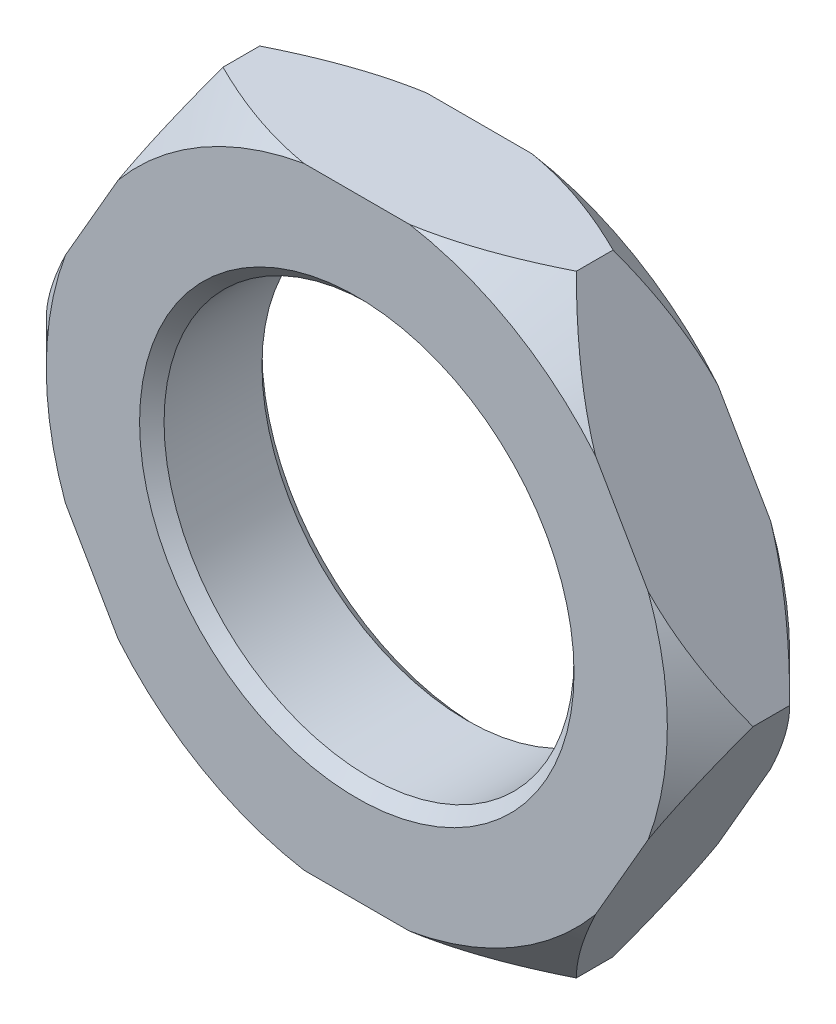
ISO-10303-21;
HEADER;
FILE_DESCRIPTION(('STEP AP214'),'2;1');
FILE_NAME('part.step','',(''),(''),'','','');
FILE_SCHEMA(('AUTOMOTIVE_DESIGN { 1 0 10303 214 1 1 1 1 }'));
ENDSEC;
DATA;
#1=APPLICATION_CONTEXT('core data for automotive mechanical design processes');
#2=APPLICATION_PROTOCOL_DEFINITION('international standard','automotive_design',2000,#1);
#3=PRODUCT_CONTEXT('',#1,'mechanical');
#4=PRODUCT('Part','Part','',(#3));
#5=PRODUCT_RELATED_PRODUCT_CATEGORY('part','',(#4));
#6=PRODUCT_DEFINITION_FORMATION('','',#4);
#7=PRODUCT_DEFINITION_CONTEXT('part definition',#1,'design');
#8=PRODUCT_DEFINITION('design','',#6,#7);
#9=PRODUCT_DEFINITION_SHAPE('','',#8);
#10=(LENGTH_UNIT() NAMED_UNIT(*) SI_UNIT(.MILLI.,.METRE.));
#11=(NAMED_UNIT(*) PLANE_ANGLE_UNIT() SI_UNIT($,.RADIAN.));
#12=(NAMED_UNIT(*) SI_UNIT($,.STERADIAN.) SOLID_ANGLE_UNIT());
#13=UNCERTAINTY_MEASURE_WITH_UNIT(LENGTH_MEASURE(1.E-05),#10,'distance_accuracy_value','');
#14=(GEOMETRIC_REPRESENTATION_CONTEXT(3) GLOBAL_UNCERTAINTY_ASSIGNED_CONTEXT((#13)) GLOBAL_UNIT_ASSIGNED_CONTEXT((#10,
#11,#12)) REPRESENTATION_CONTEXT('',''));
#15=CARTESIAN_POINT('',(0.,0.,0.));
#16=DIRECTION('',(0.,0.,1.));
#17=DIRECTION('',(1.,0.,0.));
#18=AXIS2_PLACEMENT_3D('',#15,#16,#17);
#19=CARTESIAN_POINT('',(0.,0.,-2.));
#20=DIRECTION('',(0.,0.,1.));
#21=DIRECTION('',(1.,0.,0.));
#22=AXIS2_PLACEMENT_3D('',#19,#20,#21);
#23=PLANE('',#22);
#24=CARTESIAN_POINT('',(0.,0.,-2.));
#25=DIRECTION('',(0.,0.,1.));
#26=DIRECTION('',(1.,0.,0.));
#27=AXIS2_PLACEMENT_3D('',#24,#25,#26);
#28=CIRCLE('',#27,3.55);
#29=CARTESIAN_POINT('',(3.55,0.,-2.));
#30=VERTEX_POINT('',#29);
#31=EDGE_CURVE('E257',#30,#30,#28,.T.);
#32=ORIENTED_EDGE('',*,*,#31,.T.);
#33=EDGE_LOOP('',(#32));
#34=FACE_BOUND('',#33,.T.);
#35=DIRECTION('',(0.500000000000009,-0.866025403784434,0.));
#36=VECTOR('',#35,1.);
#37=CARTESIAN_POINT('',(-4.33124999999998,-2.50064835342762,-2.));
#38=LINE('',#37,#36);
#39=CARTESIAN_POINT('',(-4.76213752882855,-1.75432926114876,-2.));
#40=VERTEX_POINT('',#39);
#41=CARTESIAN_POINT('',(-3.90036247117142,-3.24696744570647,-2.));
#42=VERTEX_POINT('',#41);
#43=EDGE_CURVE('E285',#40,#42,#38,.T.);
#44=ORIENTED_EDGE('',*,*,#43,.F.);
#45=CARTESIAN_POINT('',(0.,0.,-2.));
#46=DIRECTION('',(0.,0.,1.));
#47=DIRECTION('',(1.,0.,0.));
#48=AXIS2_PLACEMENT_3D('',#45,#46,#47);
#49=CIRCLE('',#48,5.075);
#50=CARTESIAN_POINT('',(-4.76213752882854,1.75432926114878,-2.));
#51=VERTEX_POINT('',#50);
#52=EDGE_CURVE('E77',#40,#51,#49,.F.);
#53=ORIENTED_EDGE('',*,*,#52,.T.);
#54=DIRECTION('',(-0.499999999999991,-0.866025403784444,0.));
#55=VECTOR('',#54,1.);
#56=CARTESIAN_POINT('',(-4.33125000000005,2.50064835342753,-2.));
#57=LINE('',#56,#55);
#58=CARTESIAN_POINT('',(-3.90036247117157,3.24696744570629,-2.));
#59=VERTEX_POINT('',#58);
#60=EDGE_CURVE('E205',#59,#51,#57,.T.);
#61=ORIENTED_EDGE('',*,*,#60,.F.);
#62=CARTESIAN_POINT('',(-0.861775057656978,5.00129670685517,-2.));
#63=VERTEX_POINT('',#62);
#64=EDGE_CURVE('E209',#59,#63,#49,.F.);
#65=ORIENTED_EDGE('',*,*,#64,.T.);
#66=DIRECTION('',(-1.,0.,0.));
#67=VECTOR('',#66,1.);
#68=CARTESIAN_POINT('',(0.,5.00129670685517,-2.));
#69=LINE('',#68,#67);
#70=CARTESIAN_POINT('',(0.861775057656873,5.00129670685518,-2.));
#71=VERTEX_POINT('',#70);
#72=EDGE_CURVE('E401',#71,#63,#69,.T.);
#73=ORIENTED_EDGE('',*,*,#72,.F.);
#74=CARTESIAN_POINT('',(3.9003624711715,3.24696744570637,-2.));
#75=VERTEX_POINT('',#74);
#76=EDGE_CURVE('E269',#71,#75,#49,.F.);
#77=ORIENTED_EDGE('',*,*,#76,.T.);
#78=DIRECTION('',(-0.500000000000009,0.866025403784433,0.));
#79=VECTOR('',#78,1.);
#80=CARTESIAN_POINT('',(4.33125,2.50064835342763,-2.));
#81=LINE('',#80,#79);
#82=CARTESIAN_POINT('',(4.7621375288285,1.75432926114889,-2.));
#83=VERTEX_POINT('',#82);
#84=EDGE_CURVE('E375',#83,#75,#81,.T.);
#85=ORIENTED_EDGE('',*,*,#84,.F.);
#86=CARTESIAN_POINT('',(4.76213752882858,-1.75432926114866,-2.));
#87=VERTEX_POINT('',#86);
#88=EDGE_CURVE('E273',#83,#87,#49,.F.);
#89=ORIENTED_EDGE('',*,*,#88,.T.);
#90=DIRECTION('',(0.499999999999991,0.866025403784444,0.));
#91=VECTOR('',#90,1.);
#92=CARTESIAN_POINT('',(4.33125000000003,-2.50064835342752,-2.));
#93=LINE('',#92,#91);
#94=CARTESIAN_POINT('',(3.90036247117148,-3.24696744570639,-2.));
#95=VERTEX_POINT('',#94);
#96=EDGE_CURVE('E333',#95,#87,#93,.T.);
#97=ORIENTED_EDGE('',*,*,#96,.F.);
#98=CARTESIAN_POINT('',(0.861775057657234,-5.00129670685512,-2.));
#99=VERTEX_POINT('',#98);
#100=EDGE_CURVE('E277',#95,#99,#49,.F.);
#101=ORIENTED_EDGE('',*,*,#100,.T.);
#102=DIRECTION('',(1.,0.,0.));
#103=VECTOR('',#102,1.);
#104=CARTESIAN_POINT('',(0.,-5.00129670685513,-2.));
#105=LINE('',#104,#103);
#106=CARTESIAN_POINT('',(-0.861775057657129,-5.00129670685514,-2.));
#107=VERTEX_POINT('',#106);
#108=EDGE_CURVE('E286',#107,#99,#105,.T.);
#109=ORIENTED_EDGE('',*,*,#108,.F.);
#110=EDGE_CURVE('E207',#107,#42,#49,.F.);
#111=ORIENTED_EDGE('',*,*,#110,.T.);
#112=EDGE_LOOP('',(#44,#53,#61,#65,#73,#77,#85,#89,#97,#101,#109,#111));
#113=FACE_BOUND('',#112,.T.);
#114=ADVANCED_FACE('F57',(#34,#113),#23,.F.);
#115=CARTESIAN_POINT('',(0.,0.,0.));
#116=DIRECTION('',(0.,0.,1.));
#117=DIRECTION('',(1.,0.,0.));
#118=AXIS2_PLACEMENT_3D('',#115,#116,#117);
#119=PLANE('',#118);
#120=CARTESIAN_POINT('',(0.,0.,0.));
#121=DIRECTION('',(0.,0.,1.));
#122=DIRECTION('',(1.,0.,0.));
#123=AXIS2_PLACEMENT_3D('',#120,#121,#122);
#124=CIRCLE('',#123,3.55);
#125=CARTESIAN_POINT('',(3.55,0.,0.));
#126=VERTEX_POINT('',#125);
#127=EDGE_CURVE('E246',#126,#126,#124,.F.);
#128=ORIENTED_EDGE('',*,*,#127,.T.);
#129=EDGE_LOOP('',(#128));
#130=FACE_BOUND('',#129,.T.);
#131=CARTESIAN_POINT('',(0.,0.,0.));
#132=DIRECTION('',(0.,0.,1.));
#133=DIRECTION('',(1.,0.,0.));
#134=AXIS2_PLACEMENT_3D('',#131,#132,#133);
#135=CIRCLE('',#134,5.075);
#136=CARTESIAN_POINT('',(-4.76213752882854,1.75432926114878,0.));
#137=VERTEX_POINT('',#136);
#138=CARTESIAN_POINT('',(-4.76213752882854,-1.75432926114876,0.));
#139=VERTEX_POINT('',#138);
#140=EDGE_CURVE('E251',#137,#139,#135,.T.);
#141=ORIENTED_EDGE('',*,*,#140,.T.);
#142=DIRECTION('',(0.500000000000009,-0.866025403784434,0.));
#143=VECTOR('',#142,1.);
#144=CARTESIAN_POINT('',(-4.33124999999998,-2.50064835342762,0.));
#145=LINE('',#144,#143);
#146=CARTESIAN_POINT('',(-3.90036247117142,-3.24696744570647,0.));
#147=VERTEX_POINT('',#146);
#148=EDGE_CURVE('E252',#139,#147,#145,.T.);
#149=ORIENTED_EDGE('',*,*,#148,.T.);
#150=CARTESIAN_POINT('',(-0.861775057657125,-5.00129670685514,0.));
#151=VERTEX_POINT('',#150);
#152=EDGE_CURVE('E258',#147,#151,#135,.T.);
#153=ORIENTED_EDGE('',*,*,#152,.T.);
#154=DIRECTION('',(1.,0.,0.));
#155=VECTOR('',#154,1.);
#156=CARTESIAN_POINT('',(0.,-5.00129670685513,0.));
#157=LINE('',#156,#155);
#158=CARTESIAN_POINT('',(0.86177505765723,-5.00129670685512,0.));
#159=VERTEX_POINT('',#158);
#160=EDGE_CURVE('E291',#151,#159,#157,.T.);
#161=ORIENTED_EDGE('',*,*,#160,.T.);
#162=CARTESIAN_POINT('',(3.90036247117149,-3.24696744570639,0.));
#163=VERTEX_POINT('',#162);
#164=EDGE_CURVE('E263',#159,#163,#135,.T.);
#165=ORIENTED_EDGE('',*,*,#164,.T.);
#166=DIRECTION('',(0.499999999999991,0.866025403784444,0.));
#167=VECTOR('',#166,1.);
#168=CARTESIAN_POINT('',(4.33125000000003,-2.50064835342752,0.));
#169=LINE('',#168,#167);
#170=CARTESIAN_POINT('',(4.76213752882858,-1.75432926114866,0.));
#171=VERTEX_POINT('',#170);
#172=EDGE_CURVE('E334',#163,#171,#169,.T.);
#173=ORIENTED_EDGE('',*,*,#172,.T.);
#174=CARTESIAN_POINT('',(4.7621375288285,1.75432926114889,0.));
#175=VERTEX_POINT('',#174);
#176=EDGE_CURVE('E267',#171,#175,#135,.T.);
#177=ORIENTED_EDGE('',*,*,#176,.T.);
#178=DIRECTION('',(-0.500000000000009,0.866025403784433,0.));
#179=VECTOR('',#178,1.);
#180=CARTESIAN_POINT('',(4.33125,2.50064835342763,0.));
#181=LINE('',#180,#179);
#182=CARTESIAN_POINT('',(3.9003624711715,3.24696744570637,0.));
#183=VERTEX_POINT('',#182);
#184=EDGE_CURVE('E427',#175,#183,#181,.T.);
#185=ORIENTED_EDGE('',*,*,#184,.T.);
#186=CARTESIAN_POINT('',(0.861775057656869,5.00129670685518,0.));
#187=VERTEX_POINT('',#186);
#188=EDGE_CURVE('E264',#183,#187,#135,.T.);
#189=ORIENTED_EDGE('',*,*,#188,.T.);
#190=DIRECTION('',(-1.,0.,0.));
#191=VECTOR('',#190,1.);
#192=CARTESIAN_POINT('',(0.,5.00129670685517,0.));
#193=LINE('',#192,#191);
#194=CARTESIAN_POINT('',(-0.861775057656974,5.00129670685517,0.));
#195=VERTEX_POINT('',#194);
#196=EDGE_CURVE('E402',#187,#195,#193,.T.);
#197=ORIENTED_EDGE('',*,*,#196,.T.);
#198=CARTESIAN_POINT('',(-3.90036247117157,3.24696744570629,0.));
#199=VERTEX_POINT('',#198);
#200=EDGE_CURVE('E259',#195,#199,#135,.T.);
#201=ORIENTED_EDGE('',*,*,#200,.T.);
#202=DIRECTION('',(-0.499999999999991,-0.866025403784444,0.));
#203=VECTOR('',#202,1.);
#204=CARTESIAN_POINT('',(-4.33125000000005,2.50064835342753,0.));
#205=LINE('',#204,#203);
#206=EDGE_CURVE('E255',#199,#137,#205,.T.);
#207=ORIENTED_EDGE('',*,*,#206,.T.);
#208=EDGE_LOOP('',(#141,#149,#153,#161,#165,#173,#177,#185,#189,#197,#201,#207));
#209=FACE_BOUND('',#208,.T.);
#210=ADVANCED_FACE('F234',(#130,#209),#119,.T.);
#211=CARTESIAN_POINT('',(0.,0.,-1.3));
#212=DIRECTION('',(0.,0.,1.));
#213=DIRECTION('',(1.,0.,0.));
#214=AXIS2_PLACEMENT_3D('',#211,#212,#213);
#215=CONICAL_SURFACE('',#214,5.775,0.78539816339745);
#216=CARTESIAN_POINT('',(6.37806172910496,-5.00129670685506,1.03009963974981));
#217=CARTESIAN_POINT('',(6.23511295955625,-5.00129670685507,0.917630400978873));
#218=CARTESIAN_POINT('',(6.09147779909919,-5.00129670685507,0.8060223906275));
#219=CARTESIAN_POINT('',(5.8025691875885,-5.00129670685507,0.584898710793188));
#220=CARTESIAN_POINT('',(5.65729546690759,-5.00129670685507,0.475383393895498));
#221=CARTESIAN_POINT('',(5.36415276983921,-5.00129670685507,0.258305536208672));
#222=CARTESIAN_POINT('',(5.21627438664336,-5.00129670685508,0.150755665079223));
#223=CARTESIAN_POINT('',(4.91834850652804,-5.00129670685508,-0.0612874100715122));
#224=CARTESIAN_POINT('',(4.76830111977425,-5.00129670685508,-0.165780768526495));
#225=CARTESIAN_POINT('',(4.45819578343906,-5.00129670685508,-0.376130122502));
#226=CARTESIAN_POINT('',(4.29800972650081,-5.00129670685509,-0.481797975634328));
#227=CARTESIAN_POINT('',(3.97436431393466,-5.00129670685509,-0.688061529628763));
#228=CARTESIAN_POINT('',(3.81090459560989,-5.00129670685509,-0.788656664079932));
#229=CARTESIAN_POINT('',(3.48052560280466,-5.00129670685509,-0.983264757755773));
#230=CARTESIAN_POINT('',(3.31361379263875,-5.0012967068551,-1.07729031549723));
#231=CARTESIAN_POINT('',(2.97551222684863,-5.0012967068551,-1.25725450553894));
#232=CARTESIAN_POINT('',(2.80432379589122,-5.0012967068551,-1.34319560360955));
#233=CARTESIAN_POINT('',(2.47511657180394,-5.0012967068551,-1.49645032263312));
#234=CARTESIAN_POINT('',(2.31757022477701,-5.00129670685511,-1.56477132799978));
#235=CARTESIAN_POINT('',(1.99837656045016,-5.00129670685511,-1.69122703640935));
#236=CARTESIAN_POINT('',(1.83672885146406,-5.00129670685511,-1.74936076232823));
#237=CARTESIAN_POINT('',(1.51131662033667,-5.00129670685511,-1.85259298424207));
#238=CARTESIAN_POINT('',(1.34759786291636,-5.00129670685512,-1.89783378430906));
#239=CARTESIAN_POINT('',(1.01681588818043,-5.00129670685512,-1.97392087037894));
#240=CARTESIAN_POINT('',(0.849753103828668,-5.00129670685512,-2.00476900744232));
#241=CARTESIAN_POINT('',(0.510255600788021,-5.00129670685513,-2.05060418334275));
#242=CARTESIAN_POINT('',(0.337778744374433,-5.00129670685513,-2.06528587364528));
#243=CARTESIAN_POINT('',(-0.00776380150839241,-5.00129670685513,-2.07667811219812));
#244=CARTESIAN_POINT('',(-0.180829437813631,-5.00129670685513,-2.0733902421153));
#245=CARTESIAN_POINT('',(-0.526211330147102,-5.00129670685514,-2.04905864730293));
#246=CARTESIAN_POINT('',(-0.698523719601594,-5.00129670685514,-2.02796108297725));
#247=CARTESIAN_POINT('',(-1.0403341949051,-5.00129670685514,-1.96942832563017));
#248=CARTESIAN_POINT('',(-1.20983151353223,-5.00129670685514,-1.93198875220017));
#249=CARTESIAN_POINT('',(-1.5968660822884,-5.00129670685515,-1.82922301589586));
#250=CARTESIAN_POINT('',(-1.81305332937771,-5.00129670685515,-1.75885378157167));
#251=CARTESIAN_POINT('',(-2.23829982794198,-5.00129670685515,-1.59923548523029));
#252=CARTESIAN_POINT('',(-2.44735471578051,-5.00129670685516,-1.50997509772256));
#253=CARTESIAN_POINT('',(-2.8601974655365,-5.00129670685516,-1.31651027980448));
#254=CARTESIAN_POINT('',(-3.06393587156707,-5.00129670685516,-1.21220173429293));
#255=CARTESIAN_POINT('',(-3.46537079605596,-5.00129670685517,-0.992769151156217));
#256=CARTESIAN_POINT('',(-3.66306871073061,-5.00129670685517,-0.877647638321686));
#257=CARTESIAN_POINT('',(-4.0806037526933,-5.00129670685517,-0.622614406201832));
#258=CARTESIAN_POINT('',(-4.29969080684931,-5.00129670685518,-0.481482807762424));
#259=CARTESIAN_POINT('',(-4.73260921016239,-5.00129670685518,-0.191339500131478));
#260=CARTESIAN_POINT('',(-4.94643939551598,-5.00129670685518,-0.0423260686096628));
#261=CARTESIAN_POINT('',(-5.36512507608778,-5.00129670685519,0.258265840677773));
#262=CARTESIAN_POINT('',(-5.5700744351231,-5.00129670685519,0.409714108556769));
#263=CARTESIAN_POINT('',(-5.87492176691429,-5.00129670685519,0.640132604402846));
#264=CARTESIAN_POINT('',(-5.97607424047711,-5.00129670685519,0.717453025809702));
#265=CARTESIAN_POINT('',(-6.17761822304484,-5.0012967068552,0.873071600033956));
#266=CARTESIAN_POINT('',(-6.27800976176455,-5.0012967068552,0.951369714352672));
#267=CARTESIAN_POINT('',(-6.37806172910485,-5.0012967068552,1.03009963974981));
#268=B_SPLINE_CURVE_WITH_KNOTS('',3,(#216,#217,#218,#219,#220,#221,#222,#223,#224,#225,#226,
#227,#228,#229,#230,#231,#232,#233,#234,#235,#236,#237,#238,#239,#240,#241,#242,#243,#244,#245,
#246,#247,#248,#249,#250,#251,#252,#253,#254,#255,#256,#257,#258,#259,#260,#261,#262,#263,#264,
#265,#266,#267),.UNSPECIFIED.,.F.,.F.,(4,2,2,2,2,2,2,2,2,2,2,2,2,2,2,2,2,2,2,2,2,2,2,2,2,4),(0.,
0.545674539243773,1.09144021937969,1.63996473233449,2.18846148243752,2.76408181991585,
3.33976628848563,3.91431460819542,4.48868711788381,5.0035684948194,5.51849923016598,
6.0275044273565,6.53644414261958,7.05483995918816,7.57319014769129,8.09311296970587,
8.61317524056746,9.29403361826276,9.97530134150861,10.6615313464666,11.3476015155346,
12.1291962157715,12.9109624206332,13.6753882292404,14.0573422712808,14.4392813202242),.UNSPECIFIED.);
#269=CARTESIAN_POINT('',(-2.88749999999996,-5.00129670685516,-1.3));
#270=VERTEX_POINT('',#269);
#271=EDGE_CURVE('E289',#107,#270,#268,.T.);
#272=ORIENTED_EDGE('',*,*,#271,.T.);
#273=CARTESIAN_POINT('',(-0.872223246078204,-8.49185843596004,1.46153519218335));
#274=CARTESIAN_POINT('',(-0.940661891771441,-8.37331922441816,1.3506221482));
#275=CARTESIAN_POINT('',(-1.00937220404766,-8.25430947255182,1.24037354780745));
#276=CARTESIAN_POINT('',(-1.1474303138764,-8.01518581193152,1.02145980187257));
#277=CARTESIAN_POINT('',(-1.21677816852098,-7.89507180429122,0.912794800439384));
#278=CARTESIAN_POINT('',(-1.35635878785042,-7.6533110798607,0.697067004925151));
#279=CARTESIAN_POINT('',(-1.42659326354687,-7.53166139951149,0.590008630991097));
#280=CARTESIAN_POINT('',(-1.56789153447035,-7.2869256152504,0.378108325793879));
#281=CARTESIAN_POINT('',(-1.63895530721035,-7.16383955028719,0.273266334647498));
#282=CARTESIAN_POINT('',(-1.78402073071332,-6.91257886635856,0.0633589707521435));
#283=CARTESIAN_POINT('',(-1.85804925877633,-6.78435769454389,-0.0416322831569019));
#284=CARTESIAN_POINT('',(-2.00727666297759,-6.52588824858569,-0.248230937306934));
#285=CARTESIAN_POINT('',(-2.08247549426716,-6.39564005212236,-0.349838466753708));
#286=CARTESIAN_POINT('',(-2.23416964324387,-6.13289807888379,-0.548833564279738));
#287=CARTESIAN_POINT('',(-2.31066380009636,-6.00040631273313,-0.646224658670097));
#288=CARTESIAN_POINT('',(-2.46521430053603,-5.73271699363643,-0.835894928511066));
#289=CARTESIAN_POINT('',(-2.54327044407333,-5.59751978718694,-0.928174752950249));
#290=CARTESIAN_POINT('',(-2.70310410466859,-5.32067976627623,-1.1085467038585));
#291=CARTESIAN_POINT('',(-2.78492596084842,-5.17896015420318,-1.1964827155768));
#292=CARTESIAN_POINT('',(-2.95072231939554,-4.89179243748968,-1.36396513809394));
#293=CARTESIAN_POINT('',(-3.03469712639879,-4.74634380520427,-1.44351035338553));
#294=CARTESIAN_POINT('',(-3.20452223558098,-4.45219808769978,-1.59158836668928));
#295=CARTESIAN_POINT('',(-3.2903599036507,-4.3035228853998,-1.66017852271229));
#296=CARTESIAN_POINT('',(-3.46438952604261,-4.00209473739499,-1.78421902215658));
#297=CARTESIAN_POINT('',(-3.5525807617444,-3.84934303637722,-1.83967332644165));
#298=CARTESIAN_POINT('',(-3.71368608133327,-3.57030043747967,-1.92530801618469));
#299=CARTESIAN_POINT('',(-3.7862232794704,-3.44466232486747,-1.95830863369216));
#300=CARTESIAN_POINT('',(-3.93239755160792,-3.1914810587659,-2.01252113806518));
#301=CARTESIAN_POINT('',(-4.00603446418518,-3.06393818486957,-2.03373473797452));
#302=CARTESIAN_POINT('',(-4.15383006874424,-2.80794868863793,-2.06328338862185));
#303=CARTESIAN_POINT('',(-4.22798761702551,-2.67950404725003,-2.07164099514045));
#304=CARTESIAN_POINT('',(-4.37638207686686,-2.42247730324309,-2.07508996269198));
#305=CARTESIAN_POINT('',(-4.45061898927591,-2.29389519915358,-2.07018118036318));
#306=CARTESIAN_POINT('',(-4.59838604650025,-2.03795514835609,-2.0474003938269));
#307=CARTESIAN_POINT('',(-4.67191755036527,-1.91059484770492,-2.02956308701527));
#308=CARTESIAN_POINT('',(-4.81800396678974,-1.65756575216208,-1.98187782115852));
#309=CARTESIAN_POINT('',(-4.89055864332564,-1.53189736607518,-1.95202701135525));
#310=CARTESIAN_POINT('',(-5.0345577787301,-1.28248354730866,-1.88154552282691));
#311=CARTESIAN_POINT('',(-5.10599833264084,-1.1587448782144,-1.84088331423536));
#312=CARTESIAN_POINT('',(-5.24737891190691,-0.91386653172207,-1.75032232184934));
#313=CARTESIAN_POINT('',(-5.31731900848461,-0.792726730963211,-1.70042397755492));
#314=CARTESIAN_POINT('',(-5.48041567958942,-0.510235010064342,-1.57360749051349));
#315=CARTESIAN_POINT('',(-5.57293184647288,-0.349992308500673,-1.49340758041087));
#316=CARTESIAN_POINT('',(-5.75534816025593,-0.0340379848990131,-1.32180494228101));
#317=CARTESIAN_POINT('',(-5.8452468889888,0.121671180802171,-1.23039627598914));
#318=CARTESIAN_POINT('',(-6.0228700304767,0.42932348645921,-1.03870332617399));
#319=CARTESIAN_POINT('',(-6.11058953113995,0.581258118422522,-0.938400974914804));
#320=CARTESIAN_POINT('',(-6.28396730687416,0.881557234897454,-0.731019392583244));
#321=CARTESIAN_POINT('',(-6.36962594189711,1.02992234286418,-0.623941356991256));
#322=CARTESIAN_POINT('',(-6.53959373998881,1.32431520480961,-0.403925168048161));
#323=CARTESIAN_POINT('',(-6.62389485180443,1.47032901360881,-0.290962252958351));
#324=CARTESIAN_POINT('',(-6.79101183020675,1.75978411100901,-0.0607279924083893));
#325=CARTESIAN_POINT('',(-6.87382764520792,1.90322531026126,0.0565435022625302));
#326=CARTESIAN_POINT('',(-7.03811105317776,2.18777251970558,0.294432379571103));
#327=CARTESIAN_POINT('',(-7.11957998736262,2.32888085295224,0.415046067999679));
#328=CARTESIAN_POINT('',(-7.28145059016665,2.60924896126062,0.659106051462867));
#329=CARTESIAN_POINT('',(-7.36185223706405,2.74850869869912,0.782552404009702));
#330=CARTESIAN_POINT('',(-7.50045775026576,2.98858048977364,0.998603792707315));
#331=CARTESIAN_POINT('',(-7.55887233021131,3.08975751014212,1.09066959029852));
#332=CARTESIAN_POINT('',(-7.6750132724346,3.29091952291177,1.27551367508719));
#333=CARTESIAN_POINT('',(-7.73274150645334,3.39090775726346,1.36828725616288));
#334=CARTESIAN_POINT('',(-7.79027675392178,3.49056172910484,1.46153519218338));
#335=B_SPLINE_CURVE_WITH_KNOTS('',3,(#273,#274,#275,#276,#277,#278,#279,#280,#281,#282,#283,
#284,#285,#286,#287,#288,#289,#290,#291,#292,#293,#294,#295,#296,#297,#298,#299,#300,#301,#302,
#303,#304,#305,#306,#307,#308,#309,#310,#311,#312,#313,#314,#315,#316,#317,#318,#319,#320,#321,
#322,#323,#324,#325,#326,#327,#328,#329,#330,#331,#332,#333,#334),.UNSPECIFIED.,.F.,.F.,(4,2,2,
2,2,2,2,2,2,2,2,2,2,2,2,2,2,2,2,2,2,2,2,2,2,2,2,2,2,2,4),(0.,0.528524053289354,1.0570959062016,
1.58692360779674,2.11673697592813,2.6612131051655,3.20566841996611,3.74965923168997,
4.29358081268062,4.8507111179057,5.40792069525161,5.96210978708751,6.51613156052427,
6.96204787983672,7.40789937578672,7.85296773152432,8.29804089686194,8.74192398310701,
9.18591246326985,9.63121025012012,10.0764868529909,10.6809750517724,11.2857848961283,
11.8918528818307,12.4978142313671,13.1065718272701,13.7153505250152,14.3234812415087,
14.9316243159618,15.3778537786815,15.8221822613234),.UNSPECIFIED.);
#336=EDGE_CURVE('E202',#270,#42,#335,.T.);
#337=ORIENTED_EDGE('',*,*,#336,.T.);
#338=ORIENTED_EDGE('',*,*,#110,.F.);
#339=EDGE_LOOP('',(#272,#337,#338));
#340=FACE_BOUND('',#339,.T.);
#341=ADVANCED_FACE('F237',(#340),#215,.T.);
#342=ORIENTED_EDGE('',*,*,#52,.F.);
#343=CARTESIAN_POINT('',(-5.77500000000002,0.,-1.29999999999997));
#344=VERTEX_POINT('',#343);
#345=EDGE_CURVE('E191',#40,#344,#335,.T.);
#346=ORIENTED_EDGE('',*,*,#345,.T.);
#347=CARTESIAN_POINT('',(-7.79027675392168,-3.49056172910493,1.46153519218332));
#348=CARTESIAN_POINT('',(-7.72183810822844,-3.37202251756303,1.35062214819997));
#349=CARTESIAN_POINT('',(-7.65312779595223,-3.2530127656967,1.24037354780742));
#350=CARTESIAN_POINT('',(-7.51506968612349,-3.01388910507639,1.02145980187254));
#351=CARTESIAN_POINT('',(-7.44572183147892,-2.89377509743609,0.912794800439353));
#352=CARTESIAN_POINT('',(-7.30614121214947,-2.65201437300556,0.697067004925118));
#353=CARTESIAN_POINT('',(-7.23590673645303,-2.53036469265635,0.590008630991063));
#354=CARTESIAN_POINT('',(-7.09460846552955,-2.28562890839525,0.378108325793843));
#355=CARTESIAN_POINT('',(-7.02354469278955,-2.16254284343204,0.273266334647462));
#356=CARTESIAN_POINT('',(-6.87847926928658,-1.9112821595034,0.063358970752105));
#357=CARTESIAN_POINT('',(-6.80445074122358,-1.78306098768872,-0.0416322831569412));
#358=CARTESIAN_POINT('',(-6.65522333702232,-1.52459154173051,-0.248230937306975));
#359=CARTESIAN_POINT('',(-6.58002450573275,-1.39434334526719,-0.34983846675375));
#360=CARTESIAN_POINT('',(-6.42833035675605,-1.13160137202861,-0.548833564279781));
#361=CARTESIAN_POINT('',(-6.35183619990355,-0.999109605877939,-0.64622465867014));
#362=CARTESIAN_POINT('',(-6.19728569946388,-0.731420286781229,-0.835894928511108));
#363=CARTESIAN_POINT('',(-6.11922955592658,-0.596223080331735,-0.928174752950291));
#364=CARTESIAN_POINT('',(-5.95939589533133,-0.31938305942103,-1.10854670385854));
#365=CARTESIAN_POINT('',(-5.8775740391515,-0.177663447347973,-1.19648271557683));
#366=CARTESIAN_POINT('',(-5.7117776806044,0.109504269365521,-1.36396513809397));
#367=CARTESIAN_POINT('',(-5.62780287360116,0.254952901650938,-1.44351035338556));
#368=CARTESIAN_POINT('',(-5.45797776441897,0.549098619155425,-1.5915883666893));
#369=CARTESIAN_POINT('',(-5.37214009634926,0.697773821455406,-1.6601785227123));
#370=CARTESIAN_POINT('',(-5.19811047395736,0.999201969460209,-1.78421902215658));
#371=CARTESIAN_POINT('',(-5.10991923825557,1.15195367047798,-1.83967332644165));
#372=CARTESIAN_POINT('',(-4.94881391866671,1.43099626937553,-1.92530801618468));
#373=CARTESIAN_POINT('',(-4.87627672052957,1.55663438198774,-1.95830863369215));
#374=CARTESIAN_POINT('',(-4.73010244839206,1.80981564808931,-2.01252113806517));
#375=CARTESIAN_POINT('',(-4.6564655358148,1.93735852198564,-2.03373473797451));
#376=CARTESIAN_POINT('',(-4.50866993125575,2.19334801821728,-2.06328338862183));
#377=CARTESIAN_POINT('',(-4.43451238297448,2.32179265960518,-2.07164099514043));
#378=CARTESIAN_POINT('',(-4.28611792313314,2.57881940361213,-2.07508996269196));
#379=CARTESIAN_POINT('',(-4.2118810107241,2.70740150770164,-2.07018118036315));
#380=CARTESIAN_POINT('',(-4.06411395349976,2.96334155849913,-2.04740039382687));
#381=CARTESIAN_POINT('',(-3.99058244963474,3.0907018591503,-2.02956308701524));
#382=CARTESIAN_POINT('',(-3.84449603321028,3.34373095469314,-1.98187782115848));
#383=CARTESIAN_POINT('',(-3.77194135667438,3.46939934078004,-1.95202701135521));
#384=CARTESIAN_POINT('',(-3.62794222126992,3.71881315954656,-1.88154552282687));
#385=CARTESIAN_POINT('',(-3.55650166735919,3.84255182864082,-1.84088331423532));
#386=CARTESIAN_POINT('',(-3.41512108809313,4.08743017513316,-1.7503223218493));
#387=CARTESIAN_POINT('',(-3.34518099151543,4.20856997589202,-1.70042397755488));
#388=CARTESIAN_POINT('',(-3.18208432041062,4.4910616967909,-1.57360749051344));
#389=CARTESIAN_POINT('',(-3.08956815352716,4.65130439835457,-1.49340758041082));
#390=CARTESIAN_POINT('',(-2.90715183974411,4.96725872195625,-1.32180494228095));
#391=CARTESIAN_POINT('',(-2.81725311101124,5.12296788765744,-1.23039627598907));
#392=CARTESIAN_POINT('',(-2.63962996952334,5.4306201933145,-1.0387033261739));
#393=CARTESIAN_POINT('',(-2.55191046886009,5.58255482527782,-0.938400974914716));
#394=CARTESIAN_POINT('',(-2.37853269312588,5.88285394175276,-0.731019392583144));
#395=CARTESIAN_POINT('',(-2.29287405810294,6.0312190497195,-0.623941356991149));
#396=CARTESIAN_POINT('',(-2.12290626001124,6.32561191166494,-0.403925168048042));
#397=CARTESIAN_POINT('',(-2.03860514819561,6.47162572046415,-0.290962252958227));
#398=CARTESIAN_POINT('',(-1.8714881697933,6.76108081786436,-0.060727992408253));
#399=CARTESIAN_POINT('',(-1.78867235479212,6.90452201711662,0.056543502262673));
#400=CARTESIAN_POINT('',(-1.62438894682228,7.18906922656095,0.294432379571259));
#401=CARTESIAN_POINT('',(-1.54292001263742,7.33017755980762,0.41504606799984));
#402=CARTESIAN_POINT('',(-1.38104940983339,7.61054566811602,0.659106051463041));
#403=CARTESIAN_POINT('',(-1.30064776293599,7.74980540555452,0.782552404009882));
#404=CARTESIAN_POINT('',(-1.16204224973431,7.98987719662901,0.998603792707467));
#405=CARTESIAN_POINT('',(-1.10362766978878,8.09105421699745,1.09066959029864));
#406=CARTESIAN_POINT('',(-0.987486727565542,8.29221622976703,1.27551367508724));
#407=CARTESIAN_POINT('',(-0.929758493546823,8.39220446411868,1.3682872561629));
#408=CARTESIAN_POINT('',(-0.872223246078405,8.49185843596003,1.46153519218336));
#409=B_SPLINE_CURVE_WITH_KNOTS('',3,(#347,#348,#349,#350,#351,#352,#353,#354,#355,#356,#357,
#358,#359,#360,#361,#362,#363,#364,#365,#366,#367,#368,#369,#370,#371,#372,#373,#374,#375,#376,
#377,#378,#379,#380,#381,#382,#383,#384,#385,#386,#387,#388,#389,#390,#391,#392,#393,#394,#395,
#396,#397,#398,#399,#400,#401,#402,#403,#404,#405,#406,#407,#408),.UNSPECIFIED.,.F.,.F.,(4,2,2,
2,2,2,2,2,2,2,2,2,2,2,2,2,2,2,2,2,2,2,2,2,2,2,2,2,2,2,4),(0.,0.52852405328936,1.05709590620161,
1.58692360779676,2.11673697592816,2.66121310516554,3.20566841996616,3.74965923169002,
4.29358081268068,4.85071111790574,5.40792069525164,5.96210978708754,6.51613156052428,
6.96204787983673,7.40789937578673,7.85296773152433,8.29804089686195,8.74192398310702,
9.18591246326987,9.63121025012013,10.0764868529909,10.6809750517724,11.2857848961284,
11.8918528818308,12.4978142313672,13.1065718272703,13.7153505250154,14.3234812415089,
14.931624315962,15.3778537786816,15.8221822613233),.UNSPECIFIED.);
#410=EDGE_CURVE('E201',#344,#51,#409,.T.);
#411=ORIENTED_EDGE('',*,*,#410,.T.);
#412=EDGE_LOOP('',(#342,#346,#411));
#413=FACE_BOUND('',#412,.T.);
#414=ADVANCED_FACE('F200',(#413),#215,.T.);
#415=CARTESIAN_POINT('',(0.,0.,0.));
#416=DIRECTION('',(0.,0.,-1.));
#417=DIRECTION('',(-1.,0.,0.));
#418=AXIS2_PLACEMENT_3D('',#415,#416,#417);
#419=CONICAL_SURFACE('',#418,5.075,0.785398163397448);
#420=CARTESIAN_POINT('',(-0.872223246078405,8.49185843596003,-3.46153519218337));
#421=CARTESIAN_POINT('',(-0.940661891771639,8.37331922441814,-3.35062214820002));
#422=CARTESIAN_POINT('',(-1.00937220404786,8.2543094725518,-3.24037354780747));
#423=CARTESIAN_POINT('',(-1.1474303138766,8.0151858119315,-3.02145980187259));
#424=CARTESIAN_POINT('',(-1.21677816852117,7.8950718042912,-2.9127948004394));
#425=CARTESIAN_POINT('',(-1.35635878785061,7.65331107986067,-2.69706700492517));
#426=CARTESIAN_POINT('',(-1.42659326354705,7.53166139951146,-2.59000863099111));
#427=CARTESIAN_POINT('',(-1.56789153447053,7.28692561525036,-2.37810832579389));
#428=CARTESIAN_POINT('',(-1.63895530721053,7.16383955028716,-2.27326633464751));
#429=CARTESIAN_POINT('',(-1.78402073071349,6.91257886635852,-2.06335897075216));
#430=CARTESIAN_POINT('',(-1.8580492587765,6.78435769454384,-1.95836771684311));
#431=CARTESIAN_POINT('',(-2.00727666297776,6.52588824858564,-1.75176906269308));
#432=CARTESIAN_POINT('',(-2.08247549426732,6.39564005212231,-1.6501615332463));
#433=CARTESIAN_POINT('',(-2.23416964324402,6.13289807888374,-1.45116643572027));
#434=CARTESIAN_POINT('',(-2.31066380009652,6.00040631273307,-1.35377534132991));
#435=CARTESIAN_POINT('',(-2.46521430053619,5.73271699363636,-1.16410507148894));
#436=CARTESIAN_POINT('',(-2.54327044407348,5.59751978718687,-1.07182524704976));
#437=CARTESIAN_POINT('',(-2.70310410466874,5.32067976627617,-0.891453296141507));
#438=CARTESIAN_POINT('',(-2.78492596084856,5.17896015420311,-0.803517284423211));
#439=CARTESIAN_POINT('',(-2.95072231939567,4.89179243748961,-0.636034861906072));
#440=CARTESIAN_POINT('',(-3.03469712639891,4.74634380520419,-0.55648964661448));
#441=CARTESIAN_POINT('',(-3.2045222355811,4.4521980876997,-0.408411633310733));
#442=CARTESIAN_POINT('',(-3.29035990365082,4.30352288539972,-0.339821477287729));
#443=CARTESIAN_POINT('',(-3.46438952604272,4.00209473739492,-0.21578097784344));
#444=CARTESIAN_POINT('',(-3.5525807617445,3.84934303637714,-0.160326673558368));
#445=CARTESIAN_POINT('',(-3.71368608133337,3.57030043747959,-0.0746919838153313));
#446=CARTESIAN_POINT('',(-3.7862232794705,3.44466232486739,-0.0416913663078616));
#447=CARTESIAN_POINT('',(-3.93239755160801,3.19148105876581,0.0125211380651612));
#448=CARTESIAN_POINT('',(-4.00603446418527,3.06393818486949,0.0337347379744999));
#449=CARTESIAN_POINT('',(-4.15383006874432,2.80794868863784,0.0632833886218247));
#450=CARTESIAN_POINT('',(-4.22798761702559,2.67950404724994,0.0716409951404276));
#451=CARTESIAN_POINT('',(-4.37638207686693,2.42247730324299,0.0750899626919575));
#452=CARTESIAN_POINT('',(-4.45061898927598,2.29389519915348,0.070181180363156));
#453=CARTESIAN_POINT('',(-4.59838604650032,2.03795514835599,0.0474003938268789));
#454=CARTESIAN_POINT('',(-4.67191755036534,1.91059484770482,0.0295630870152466));
#455=CARTESIAN_POINT('',(-4.8180039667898,1.65756575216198,-0.0181221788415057));
#456=CARTESIAN_POINT('',(-4.8905586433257,1.53189736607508,-0.0479729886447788));
#457=CARTESIAN_POINT('',(-5.03455777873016,1.28248354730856,-0.118454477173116));
#458=CARTESIAN_POINT('',(-5.10599833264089,1.15874487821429,-0.159116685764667));
#459=CARTESIAN_POINT('',(-5.24737891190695,0.91386653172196,-0.249677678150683));
#460=CARTESIAN_POINT('',(-5.31731900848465,0.792726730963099,-0.299576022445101));
#461=CARTESIAN_POINT('',(-5.48041567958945,0.510235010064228,-0.426392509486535));
#462=CARTESIAN_POINT('',(-5.57293184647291,0.349992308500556,-0.506592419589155));
#463=CARTESIAN_POINT('',(-5.75534816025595,0.0340379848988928,-0.678195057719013));
#464=CARTESIAN_POINT('',(-5.84524688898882,-0.121671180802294,-0.76960372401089));
#465=CARTESIAN_POINT('',(-6.02287003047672,-0.429323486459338,-0.961296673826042));
#466=CARTESIAN_POINT('',(-6.11058953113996,-0.581258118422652,-1.06159902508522));
#467=CARTESIAN_POINT('',(-6.28396730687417,-0.881557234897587,-1.26898060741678));
#468=CARTESIAN_POINT('',(-6.36962594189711,-1.02992234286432,-1.37605864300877));
#469=CARTESIAN_POINT('',(-6.5395937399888,-1.32431520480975,-1.59607483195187));
#470=CARTESIAN_POINT('',(-6.62389485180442,-1.47032901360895,-1.70903774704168));
#471=CARTESIAN_POINT('',(-6.79101183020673,-1.75978411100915,-1.93927200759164));
#472=CARTESIAN_POINT('',(-6.8738276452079,-1.90322531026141,-2.05654350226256));
#473=CARTESIAN_POINT('',(-7.03811105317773,-2.18777251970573,-2.29443237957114));
#474=CARTESIAN_POINT('',(-7.11957998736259,-2.32888085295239,-2.41504606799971));
#475=CARTESIAN_POINT('',(-7.28145059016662,-2.60924896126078,-2.6591060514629));
#476=CARTESIAN_POINT('',(-7.36185223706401,-2.74850869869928,-2.78255240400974));
#477=CARTESIAN_POINT('',(-7.50045775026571,-2.98858048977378,-2.99860379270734));
#478=CARTESIAN_POINT('',(-7.55887233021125,-3.08975751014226,-3.09066959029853));
#479=CARTESIAN_POINT('',(-7.67501327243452,-3.29091952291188,-3.27551367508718));
#480=CARTESIAN_POINT('',(-7.73274150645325,-3.39090775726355,-3.36828725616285));
#481=CARTESIAN_POINT('',(-7.79027675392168,-3.49056172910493,-3.46153519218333));
#482=B_SPLINE_CURVE_WITH_KNOTS('',3,(#420,#421,#422,#423,#424,#425,#426,#427,#428,#429,#430,
#431,#432,#433,#434,#435,#436,#437,#438,#439,#440,#441,#442,#443,#444,#445,#446,#447,#448,#449,
#450,#451,#452,#453,#454,#455,#456,#457,#458,#459,#460,#461,#462,#463,#464,#465,#466,#467,#468,
#469,#470,#471,#472,#473,#474,#475,#476,#477,#478,#479,#480,#481),.UNSPECIFIED.,.F.,.F.,(4,2,2,
2,2,2,2,2,2,2,2,2,2,2,2,2,2,2,2,2,2,2,2,2,2,2,2,2,2,2,4),(0.,0.528524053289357,1.05709590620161,
1.58692360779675,2.11673697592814,2.66121310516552,3.20566841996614,3.74965923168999,
4.29358081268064,4.85071111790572,5.40792069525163,5.96210978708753,6.51613156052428,
6.96204787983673,7.40789937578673,7.85296773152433,8.29804089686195,8.74192398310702,
9.18591246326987,9.63121025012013,10.0764868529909,10.6809750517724,11.2857848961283,
11.8918528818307,12.4978142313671,13.1065718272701,13.7153505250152,14.3234812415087,
14.9316243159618,15.3778537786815,15.8221822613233),.UNSPECIFIED.);
#483=CARTESIAN_POINT('',(-5.77500000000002,0.,-0.700000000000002));
#484=VERTEX_POINT('',#483);
#485=EDGE_CURVE('E61',#137,#484,#482,.T.);
#486=ORIENTED_EDGE('',*,*,#485,.T.);
#487=CARTESIAN_POINT('',(-7.79027675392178,3.49056172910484,-3.46153519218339));
#488=CARTESIAN_POINT('',(-7.72183810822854,3.37202251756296,-3.35062214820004));
#489=CARTESIAN_POINT('',(-7.65312779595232,3.25301276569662,-3.24037354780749));
#490=CARTESIAN_POINT('',(-7.51506968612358,3.01388910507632,-3.02145980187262));
#491=CARTESIAN_POINT('',(-7.44572183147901,2.89377509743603,-2.91279480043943));
#492=CARTESIAN_POINT('',(-7.30614121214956,2.6520143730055,-2.6970670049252));
#493=CARTESIAN_POINT('',(-7.23590673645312,2.5303646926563,-2.59000863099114));
#494=CARTESIAN_POINT('',(-7.09460846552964,2.2856289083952,-2.37810832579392));
#495=CARTESIAN_POINT('',(-7.02354469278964,2.162542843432,-2.27326633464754));
#496=CARTESIAN_POINT('',(-6.87847926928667,1.91128215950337,-2.06335897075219));
#497=CARTESIAN_POINT('',(-6.80445074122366,1.7830609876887,-1.95836771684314));
#498=CARTESIAN_POINT('',(-6.6552233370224,1.5245915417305,-1.75176906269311));
#499=CARTESIAN_POINT('',(-6.58002450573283,1.39434334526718,-1.65016153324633));
#500=CARTESIAN_POINT('',(-6.42833035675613,1.13160137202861,-1.4511664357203));
#501=CARTESIAN_POINT('',(-6.35183619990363,0.999109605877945,-1.35377534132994));
#502=CARTESIAN_POINT('',(-6.19728569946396,0.731420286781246,-1.16410507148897));
#503=CARTESIAN_POINT('',(-6.11922955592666,0.596223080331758,-1.07182524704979));
#504=CARTESIAN_POINT('',(-5.9593958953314,0.319383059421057,-0.891453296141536));
#505=CARTESIAN_POINT('',(-5.87757403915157,0.177663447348,-0.803517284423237));
#506=CARTESIAN_POINT('',(-5.71177768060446,-0.109504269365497,-0.636034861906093));
#507=CARTESIAN_POINT('',(-5.62780287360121,-0.254952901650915,-0.556489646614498));
#508=CARTESIAN_POINT('',(-5.45797776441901,-0.549098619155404,-0.408411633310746));
#509=CARTESIAN_POINT('',(-5.37214009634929,-0.697773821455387,-0.339821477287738));
#510=CARTESIAN_POINT('',(-5.19811047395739,-0.999201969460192,-0.215780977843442));
#511=CARTESIAN_POINT('',(-5.1099192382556,-1.15195367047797,-0.160326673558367));
#512=CARTESIAN_POINT('',(-4.94881391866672,-1.43099626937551,-0.0746919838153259));
#513=CARTESIAN_POINT('',(-4.87627672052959,-1.55663438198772,-0.0416913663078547));
#514=CARTESIAN_POINT('',(-4.73010244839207,-1.80981564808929,0.0125211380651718));
#515=CARTESIAN_POINT('',(-4.65646553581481,-1.93735852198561,0.0337347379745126));
#516=CARTESIAN_POINT('',(-4.50866993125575,-2.19334801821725,0.0632833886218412));
#517=CARTESIAN_POINT('',(-4.43451238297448,-2.32179265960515,0.0716409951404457));
#518=CARTESIAN_POINT('',(-4.28611792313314,-2.5788194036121,0.0750899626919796));
#519=CARTESIAN_POINT('',(-4.21188101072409,-2.70740150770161,0.0701811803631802));
#520=CARTESIAN_POINT('',(-4.06411395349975,-2.9633415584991,0.0474003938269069));
#521=CARTESIAN_POINT('',(-3.99058244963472,-3.09070185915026,0.0295630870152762));
#522=CARTESIAN_POINT('',(-3.84449603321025,-3.3437309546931,-0.0181221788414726));
#523=CARTESIAN_POINT('',(-3.77194135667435,-3.46939934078,-0.047972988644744));
#524=CARTESIAN_POINT('',(-3.62794222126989,-3.71881315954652,-0.118454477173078));
#525=CARTESIAN_POINT('',(-3.55650166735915,-3.84255182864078,-0.159116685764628));
#526=CARTESIAN_POINT('',(-3.41512108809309,-4.08743017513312,-0.249677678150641));
#527=CARTESIAN_POINT('',(-3.34518099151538,-4.20856997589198,-0.299576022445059));
#528=CARTESIAN_POINT('',(-3.18208432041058,-4.49106169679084,-0.426392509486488));
#529=CARTESIAN_POINT('',(-3.08956815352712,-4.6513043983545,-0.506592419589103));
#530=CARTESIAN_POINT('',(-2.90715183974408,-4.96725872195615,-0.678195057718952));
#531=CARTESIAN_POINT('',(-2.81725311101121,-5.12296788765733,-0.769603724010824));
#532=CARTESIAN_POINT('',(-2.63962996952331,-5.43062019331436,-0.961296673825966));
#533=CARTESIAN_POINT('',(-2.55191046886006,-5.58255482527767,-1.06159902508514));
#534=CARTESIAN_POINT('',(-2.37853269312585,-5.88285394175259,-1.2689806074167));
#535=CARTESIAN_POINT('',(-2.29287405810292,-6.03121904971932,-1.37605864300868));
#536=CARTESIAN_POINT('',(-2.12290626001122,-6.32561191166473,-1.59607483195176));
#537=CARTESIAN_POINT('',(-2.0386051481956,-6.47162572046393,-1.70903774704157));
#538=CARTESIAN_POINT('',(-1.87148816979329,-6.76108081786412,-1.93927200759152));
#539=CARTESIAN_POINT('',(-1.78867235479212,-6.90452201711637,-2.05654350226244));
#540=CARTESIAN_POINT('',(-1.62438894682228,-7.18906922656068,-2.294432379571));
#541=CARTESIAN_POINT('',(-1.54292001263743,-7.33017755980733,-2.41504606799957));
#542=CARTESIAN_POINT('',(-1.3810494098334,-7.61054566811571,-2.65910605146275));
#543=CARTESIAN_POINT('',(-1.30064776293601,-7.7498054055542,-2.78255240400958));
#544=CARTESIAN_POINT('',(-1.16204224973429,-7.98987719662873,-2.9986037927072));
#545=CARTESIAN_POINT('',(-1.10362766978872,-8.09105421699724,-3.09066959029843));
#546=CARTESIAN_POINT('',(-0.987486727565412,-8.29221622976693,-3.27551367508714));
#547=CARTESIAN_POINT('',(-0.929758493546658,-8.39220446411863,-3.36828725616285));
#548=CARTESIAN_POINT('',(-0.872223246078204,-8.49185843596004,-3.46153519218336));
#549=B_SPLINE_CURVE_WITH_KNOTS('',3,(#487,#488,#489,#490,#491,#492,#493,#494,#495,#496,#497,
#498,#499,#500,#501,#502,#503,#504,#505,#506,#507,#508,#509,#510,#511,#512,#513,#514,#515,#516,
#517,#518,#519,#520,#521,#522,#523,#524,#525,#526,#527,#528,#529,#530,#531,#532,#533,#534,#535,
#536,#537,#538,#539,#540,#541,#542,#543,#544,#545,#546,#547,#548),.UNSPECIFIED.,.F.,.F.,(4,2,2,
2,2,2,2,2,2,2,2,2,2,2,2,2,2,2,2,2,2,2,2,2,2,2,2,2,2,2,4),(0.,0.528524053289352,1.0570959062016,
1.58692360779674,2.11673697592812,2.6612131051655,3.2056684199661,3.74965923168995,
4.2935808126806,4.85071111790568,5.4079206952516,5.96210978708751,6.51613156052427,
6.96204787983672,7.40789937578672,7.85296773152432,8.29804089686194,8.74192398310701,
9.18591246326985,9.63121025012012,10.0764868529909,10.6809750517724,11.2857848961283,
11.8918528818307,12.497814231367,13.10657182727,13.7153505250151,14.3234812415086,
14.9316243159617,15.3778537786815,15.8221822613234),.UNSPECIFIED.);
#550=EDGE_CURVE('E193',#484,#139,#549,.T.);
#551=ORIENTED_EDGE('',*,*,#550,.T.);
#552=ORIENTED_EDGE('',*,*,#140,.F.);
#553=EDGE_LOOP('',(#486,#551,#552));
#554=FACE_BOUND('',#553,.T.);
#555=ADVANCED_FACE('F350',(#554),#419,.T.);
#556=ORIENTED_EDGE('',*,*,#152,.F.);
#557=CARTESIAN_POINT('',(-2.88749999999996,-5.00129670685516,-0.700000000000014));
#558=VERTEX_POINT('',#557);
#559=EDGE_CURVE('E301',#147,#558,#549,.T.);
#560=ORIENTED_EDGE('',*,*,#559,.T.);
#561=CARTESIAN_POINT('',(-6.37806172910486,-5.0012967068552,-3.03009963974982));
#562=CARTESIAN_POINT('',(-6.23511295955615,-5.0012967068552,-2.91763040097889));
#563=CARTESIAN_POINT('',(-6.09147779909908,-5.00129670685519,-2.80602239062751));
#564=CARTESIAN_POINT('',(-5.8025691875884,-5.00129670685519,-2.5848987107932));
#565=CARTESIAN_POINT('',(-5.65729546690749,-5.00129670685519,-2.47538339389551));
#566=CARTESIAN_POINT('',(-5.36415276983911,-5.00129670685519,-2.25830553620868));
#567=CARTESIAN_POINT('',(-5.21627438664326,-5.00129670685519,-2.15075566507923));
#568=CARTESIAN_POINT('',(-4.91834850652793,-5.00129670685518,-1.9387125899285));
#569=CARTESIAN_POINT('',(-4.76830111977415,-5.00129670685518,-1.83421923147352));
#570=CARTESIAN_POINT('',(-4.45819578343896,-5.00129670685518,-1.62386987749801));
#571=CARTESIAN_POINT('',(-4.29800972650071,-5.00129670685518,-1.51820202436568));
#572=CARTESIAN_POINT('',(-3.97436431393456,-5.00129670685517,-1.31193847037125));
#573=CARTESIAN_POINT('',(-3.8109045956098,-5.00129670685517,-1.21134333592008));
#574=CARTESIAN_POINT('',(-3.48052560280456,-5.00129670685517,-1.01673524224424));
#575=CARTESIAN_POINT('',(-3.31361379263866,-5.00129670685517,-0.922709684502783));
#576=CARTESIAN_POINT('',(-2.97551222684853,-5.00129670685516,-0.74274549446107));
#577=CARTESIAN_POINT('',(-2.80432379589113,-5.00129670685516,-0.65680439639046));
#578=CARTESIAN_POINT('',(-2.47511657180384,-5.00129670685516,-0.503549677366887));
#579=CARTESIAN_POINT('',(-2.31757022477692,-5.00129670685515,-0.435228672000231));
#580=CARTESIAN_POINT('',(-1.99837656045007,-5.00129670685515,-0.308772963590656));
#581=CARTESIAN_POINT('',(-1.83672885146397,-5.00129670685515,-0.250639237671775));
#582=CARTESIAN_POINT('',(-1.51131662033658,-5.00129670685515,-0.147407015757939));
#583=CARTESIAN_POINT('',(-1.34759786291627,-5.00129670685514,-0.102166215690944));
#584=CARTESIAN_POINT('',(-1.01681588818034,-5.00129670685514,-0.0260791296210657));
#585=CARTESIAN_POINT('',(-0.849753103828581,-5.00129670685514,0.00476900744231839));
#586=CARTESIAN_POINT('',(-0.510255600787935,-5.00129670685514,0.0506041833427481));
#587=CARTESIAN_POINT('',(-0.337778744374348,-5.00129670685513,0.0652858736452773));
#588=CARTESIAN_POINT('',(0.00776380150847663,-5.00129670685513,0.0766781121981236));
#589=CARTESIAN_POINT('',(0.180829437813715,-5.00129670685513,0.0733902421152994));
#590=CARTESIAN_POINT('',(0.526211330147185,-5.00129670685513,0.0490586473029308));
#591=CARTESIAN_POINT('',(0.698523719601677,-5.00129670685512,0.027961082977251));
#592=CARTESIAN_POINT('',(1.04033419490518,-5.00129670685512,-0.0305716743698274));
#593=CARTESIAN_POINT('',(1.20983151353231,-5.00129670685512,-0.0680112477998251));
#594=CARTESIAN_POINT('',(1.59686608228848,-5.00129670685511,-0.17077698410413));
#595=CARTESIAN_POINT('',(1.81305332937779,-5.00129670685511,-0.241146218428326));
#596=CARTESIAN_POINT('',(2.23829982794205,-5.00129670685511,-0.400764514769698));
#597=CARTESIAN_POINT('',(2.44735471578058,-5.0012967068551,-0.490024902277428));
#598=CARTESIAN_POINT('',(2.86019746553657,-5.0012967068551,-0.683489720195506));
#599=CARTESIAN_POINT('',(3.06393587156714,-5.0012967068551,-0.787798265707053));
#600=CARTESIAN_POINT('',(3.46537079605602,-5.00129670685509,-1.00723084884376));
#601=CARTESIAN_POINT('',(3.66306871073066,-5.00129670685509,-1.12235236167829));
#602=CARTESIAN_POINT('',(4.08060375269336,-5.00129670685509,-1.37738559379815));
#603=CARTESIAN_POINT('',(4.29969080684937,-5.00129670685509,-1.51851719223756));
#604=CARTESIAN_POINT('',(4.73260921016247,-5.00129670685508,-1.80866049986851));
#605=CARTESIAN_POINT('',(4.94643939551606,-5.00129670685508,-1.95767393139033));
#606=CARTESIAN_POINT('',(5.36512507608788,-5.00129670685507,-2.25826584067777));
#607=CARTESIAN_POINT('',(5.57007443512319,-5.00129670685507,-2.40971410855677));
#608=CARTESIAN_POINT('',(5.87492176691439,-5.00129670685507,-2.64013260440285));
#609=CARTESIAN_POINT('',(5.97607424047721,-5.00129670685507,-2.71745302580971));
#610=CARTESIAN_POINT('',(6.17761822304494,-5.00129670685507,-2.87307160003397));
#611=CARTESIAN_POINT('',(6.27800976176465,-5.00129670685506,-2.95136971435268));
#612=CARTESIAN_POINT('',(6.37806172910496,-5.00129670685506,-3.03009963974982));
#613=B_SPLINE_CURVE_WITH_KNOTS('',3,(#561,#562,#563,#564,#565,#566,#567,#568,#569,#570,#571,
#572,#573,#574,#575,#576,#577,#578,#579,#580,#581,#582,#583,#584,#585,#586,#587,#588,#589,#590,
#591,#592,#593,#594,#595,#596,#597,#598,#599,#600,#601,#602,#603,#604,#605,#606,#607,#608,#609,
#610,#611,#612),.UNSPECIFIED.,.F.,.F.,(4,2,2,2,2,2,2,2,2,2,2,2,2,2,2,2,2,2,2,2,2,2,2,2,2,4),(0.,
0.545674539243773,1.09144021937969,1.63996473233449,2.18846148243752,2.76408181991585,
3.33976628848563,3.91431460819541,4.48868711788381,5.00356849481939,5.51849923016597,
6.02750442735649,6.53644414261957,7.05483995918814,7.57319014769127,8.09311296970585,
8.61317524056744,9.29403361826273,9.97530134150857,10.6615313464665,11.3476015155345,
12.1291962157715,12.9109624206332,13.6753882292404,14.0573422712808,14.4392813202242),.UNSPECIFIED.);
#614=EDGE_CURVE('E330',#558,#151,#613,.T.);
#615=ORIENTED_EDGE('',*,*,#614,.T.);
#616=EDGE_LOOP('',(#556,#560,#615));
#617=FACE_BOUND('',#616,.T.);
#618=ADVANCED_FACE('F353',(#617),#419,.T.);
#619=CARTESIAN_POINT('',(7.79027675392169,3.49056172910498,1.46153519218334));
#620=CARTESIAN_POINT('',(7.72183810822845,3.37202251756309,1.35062214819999));
#621=CARTESIAN_POINT('',(7.65312779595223,3.25301276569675,1.24037354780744));
#622=CARTESIAN_POINT('',(7.5150696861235,3.01388910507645,1.02145980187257));
#623=CARTESIAN_POINT('',(7.44572183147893,2.89377509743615,0.912794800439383));
#624=CARTESIAN_POINT('',(7.30614121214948,2.65201437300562,0.69706700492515));
#625=CARTESIAN_POINT('',(7.23590673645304,2.53036469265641,0.590008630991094));
#626=CARTESIAN_POINT('',(7.09460846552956,2.28562890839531,0.378108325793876));
#627=CARTESIAN_POINT('',(7.02354469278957,2.16254284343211,0.273266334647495));
#628=CARTESIAN_POINT('',(6.8784792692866,1.91128215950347,0.0633589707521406));
#629=CARTESIAN_POINT('',(6.80445074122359,1.7830609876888,-0.041632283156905));
#630=CARTESIAN_POINT('',(6.65522333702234,1.52459154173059,-0.248230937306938));
#631=CARTESIAN_POINT('',(6.58002450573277,1.39434334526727,-0.349838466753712));
#632=CARTESIAN_POINT('',(6.42833035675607,1.13160137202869,-0.548833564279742));
#633=CARTESIAN_POINT('',(6.35183619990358,0.999109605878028,-0.646224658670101));
#634=CARTESIAN_POINT('',(6.19728569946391,0.731420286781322,-0.835894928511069));
#635=CARTESIAN_POINT('',(6.11922955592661,0.596223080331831,-0.928174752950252));
#636=CARTESIAN_POINT('',(5.95939589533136,0.319383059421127,-1.1085467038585));
#637=CARTESIAN_POINT('',(5.87757403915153,0.177663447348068,-1.1964827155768));
#638=CARTESIAN_POINT('',(5.71177768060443,-0.10950426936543,-1.36396513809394));
#639=CARTESIAN_POINT('',(5.62780287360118,-0.254952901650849,-1.44351035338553));
#640=CARTESIAN_POINT('',(5.457977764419,-0.549098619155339,-1.59158836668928));
#641=CARTESIAN_POINT('',(5.37214009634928,-0.697773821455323,-1.66017852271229));
#642=CARTESIAN_POINT('',(5.19811047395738,-0.99920196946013,-1.78421902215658));
#643=CARTESIAN_POINT('',(5.10991923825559,-1.15195367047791,-1.83967332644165));
#644=CARTESIAN_POINT('',(4.94881391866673,-1.43099626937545,-1.92530801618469));
#645=CARTESIAN_POINT('',(4.87627672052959,-1.55663438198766,-1.95830863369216));
#646=CARTESIAN_POINT('',(4.73010244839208,-1.80981564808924,-2.01252113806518));
#647=CARTESIAN_POINT('',(4.65646553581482,-1.93735852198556,-2.03373473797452));
#648=CARTESIAN_POINT('',(4.50866993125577,-2.1933480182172,-2.06328338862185));
#649=CARTESIAN_POINT('',(4.4345123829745,-2.3217926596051,-2.07164099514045));
#650=CARTESIAN_POINT('',(4.28611792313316,-2.57881940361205,-2.07508996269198));
#651=CARTESIAN_POINT('',(4.21188101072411,-2.70740150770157,-2.07018118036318));
#652=CARTESIAN_POINT('',(4.06411395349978,-2.96334155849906,-2.0474003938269));
#653=CARTESIAN_POINT('',(3.99058244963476,-3.09070185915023,-2.02956308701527));
#654=CARTESIAN_POINT('',(3.8444960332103,-3.34373095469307,-1.98187782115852));
#655=CARTESIAN_POINT('',(3.7719413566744,-3.46939934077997,-1.95202701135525));
#656=CARTESIAN_POINT('',(3.62794222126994,-3.71881315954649,-1.88154552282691));
#657=CARTESIAN_POINT('',(3.5565016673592,-3.84255182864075,-1.84088331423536));
#658=CARTESIAN_POINT('',(3.41512108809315,-4.08743017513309,-1.75032232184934));
#659=CARTESIAN_POINT('',(3.34518099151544,-4.20856997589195,-1.70042397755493));
#660=CARTESIAN_POINT('',(3.18208432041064,-4.49106169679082,-1.57360749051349));
#661=CARTESIAN_POINT('',(3.08956815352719,-4.65130439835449,-1.49340758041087));
#662=CARTESIAN_POINT('',(2.90715183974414,-4.96725872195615,-1.32180494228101));
#663=CARTESIAN_POINT('',(2.81725311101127,-5.12296788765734,-1.23039627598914));
#664=CARTESIAN_POINT('',(2.63962996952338,-5.43062019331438,-1.03870332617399));
#665=CARTESIAN_POINT('',(2.55191046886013,-5.5825548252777,-0.938400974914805));
#666=CARTESIAN_POINT('',(2.37853269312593,-5.88285394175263,-0.731019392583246));
#667=CARTESIAN_POINT('',(2.29287405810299,-6.03121904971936,-0.623941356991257));
#668=CARTESIAN_POINT('',(2.1229062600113,-6.32561191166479,-0.403925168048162));
#669=CARTESIAN_POINT('',(2.03860514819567,-6.471625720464,-0.290962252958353));
#670=CARTESIAN_POINT('',(1.87148816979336,-6.76108081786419,-0.0607279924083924));
#671=CARTESIAN_POINT('',(1.78867235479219,-6.90452201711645,0.0565435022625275));
#672=CARTESIAN_POINT('',(1.62438894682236,-7.18906922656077,0.294432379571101));
#673=CARTESIAN_POINT('',(1.5429200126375,-7.33017755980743,0.415046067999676));
#674=CARTESIAN_POINT('',(1.38104940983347,-7.61054566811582,0.659106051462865));
#675=CARTESIAN_POINT('',(1.30064776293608,-7.74980540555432,0.7825524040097));
#676=CARTESIAN_POINT('',(1.16204224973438,-7.98987719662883,0.998603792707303));
#677=CARTESIAN_POINT('',(1.10362766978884,-8.09105421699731,1.0906695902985));
#678=CARTESIAN_POINT('',(0.987486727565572,-8.29221622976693,1.27551367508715));
#679=CARTESIAN_POINT('',(0.929758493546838,-8.39220446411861,1.36828725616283));
#680=CARTESIAN_POINT('',(0.872223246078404,-8.49185843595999,1.46153519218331));
#681=B_SPLINE_CURVE_WITH_KNOTS('',3,(#619,#620,#621,#622,#623,#624,#625,#626,#627,#628,#629,
#630,#631,#632,#633,#634,#635,#636,#637,#638,#639,#640,#641,#642,#643,#644,#645,#646,#647,#648,
#649,#650,#651,#652,#653,#654,#655,#656,#657,#658,#659,#660,#661,#662,#663,#664,#665,#666,#667,
#668,#669,#670,#671,#672,#673,#674,#675,#676,#677,#678,#679,#680),.UNSPECIFIED.,.F.,.F.,(4,2,2,
2,2,2,2,2,2,2,2,2,2,2,2,2,2,2,2,2,2,2,2,2,2,2,2,2,2,2,4),(0.,0.528524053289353,1.0570959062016,
1.58692360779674,2.11673697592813,2.66121310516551,3.20566841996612,3.74965923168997,
4.29358081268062,4.8507111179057,5.40792069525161,5.96210978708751,6.51613156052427,
6.96204787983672,7.40789937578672,7.85296773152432,8.29804089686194,8.74192398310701,
9.18591246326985,9.63121025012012,10.0764868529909,10.6809750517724,11.2857848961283,
11.8918528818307,12.4978142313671,13.1065718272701,13.7153505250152,14.3234812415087,
14.9316243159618,15.3778537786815,15.8221822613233),.UNSPECIFIED.);
#682=CARTESIAN_POINT('',(2.88750000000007,-5.0012967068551,-1.29999999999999));
#683=VERTEX_POINT('',#682);
#684=EDGE_CURVE('E345',#95,#683,#681,.T.);
#685=ORIENTED_EDGE('',*,*,#684,.T.);
#686=EDGE_CURVE('E329',#683,#99,#268,.T.);
#687=ORIENTED_EDGE('',*,*,#686,.T.);
#688=ORIENTED_EDGE('',*,*,#100,.F.);
#689=EDGE_LOOP('',(#685,#687,#688));
#690=FACE_BOUND('',#689,.T.);
#691=ADVANCED_FACE('F504',(#690),#215,.T.);
#692=ORIENTED_EDGE('',*,*,#164,.F.);
#693=CARTESIAN_POINT('',(2.88750000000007,-5.0012967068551,-0.700000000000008));
#694=VERTEX_POINT('',#693);
#695=EDGE_CURVE('E319',#159,#694,#613,.T.);
#696=ORIENTED_EDGE('',*,*,#695,.T.);
#697=CARTESIAN_POINT('',(0.872223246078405,-8.49185843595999,-3.46153519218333));
#698=CARTESIAN_POINT('',(0.940661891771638,-8.3733192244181,-3.35062214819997));
#699=CARTESIAN_POINT('',(1.00937220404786,-8.25430947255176,-3.24037354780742));
#700=CARTESIAN_POINT('',(1.14743031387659,-8.01518581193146,-3.02145980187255));
#701=CARTESIAN_POINT('',(1.21677816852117,-7.89507180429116,-2.91279480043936));
#702=CARTESIAN_POINT('',(1.35635878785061,-7.65331107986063,-2.69706700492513));
#703=CARTESIAN_POINT('',(1.42659326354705,-7.53166139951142,-2.59000863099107));
#704=CARTESIAN_POINT('',(1.56789153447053,-7.28692561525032,-2.37810832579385));
#705=CARTESIAN_POINT('',(1.63895530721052,-7.16383955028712,-2.27326633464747));
#706=CARTESIAN_POINT('',(1.78402073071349,-6.91257886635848,-2.06335897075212));
#707=CARTESIAN_POINT('',(1.8580492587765,-6.7843576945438,-1.95836771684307));
#708=CARTESIAN_POINT('',(2.00727666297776,-6.5258882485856,-1.75176906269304));
#709=CARTESIAN_POINT('',(2.08247549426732,-6.39564005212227,-1.65016153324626));
#710=CARTESIAN_POINT('',(2.23416964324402,-6.1328980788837,-1.45116643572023));
#711=CARTESIAN_POINT('',(2.31066380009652,-6.00040631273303,-1.35377534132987));
#712=CARTESIAN_POINT('',(2.46521430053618,-5.73271699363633,-1.16410507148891));
#713=CARTESIAN_POINT('',(2.54327044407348,-5.59751978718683,-1.07182524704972));
#714=CARTESIAN_POINT('',(2.70310410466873,-5.32067976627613,-0.891453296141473));
#715=CARTESIAN_POINT('',(2.78492596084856,-5.17896015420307,-0.803517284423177));
#716=CARTESIAN_POINT('',(2.95072231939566,-4.89179243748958,-0.636034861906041));
#717=CARTESIAN_POINT('',(3.03469712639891,-4.74634380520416,-0.556489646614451));
#718=CARTESIAN_POINT('',(3.20452223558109,-4.45219808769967,-0.408411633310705));
#719=CARTESIAN_POINT('',(3.29035990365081,-4.30352288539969,-0.339821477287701));
#720=CARTESIAN_POINT('',(3.46438952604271,-4.00209473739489,-0.215780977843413));
#721=CARTESIAN_POINT('',(3.55258076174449,-3.84934303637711,-0.160326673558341));
#722=CARTESIAN_POINT('',(3.71368608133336,-3.57030043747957,-0.0746919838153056));
#723=CARTESIAN_POINT('',(3.78622327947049,-3.44466232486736,-0.0416913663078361));
#724=CARTESIAN_POINT('',(3.932397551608,-3.19148105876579,0.0125211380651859));
#725=CARTESIAN_POINT('',(4.00603446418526,-3.06393818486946,0.033734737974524));
#726=CARTESIAN_POINT('',(4.15383006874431,-2.80794868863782,0.0632833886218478));
#727=CARTESIAN_POINT('',(4.22798761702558,-2.67950404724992,0.0716409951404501));
#728=CARTESIAN_POINT('',(4.37638207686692,-2.42247730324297,0.0750899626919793));
#729=CARTESIAN_POINT('',(4.45061898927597,-2.29389519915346,0.0701811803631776));
#730=CARTESIAN_POINT('',(4.5983860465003,-2.03795514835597,0.0474003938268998));
#731=CARTESIAN_POINT('',(4.67191755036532,-1.91059484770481,0.0295630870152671));
#732=CARTESIAN_POINT('',(4.81800396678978,-1.65756575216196,-0.018122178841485));
#733=CARTESIAN_POINT('',(4.89055864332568,-1.53189736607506,-0.0479729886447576));
#734=CARTESIAN_POINT('',(5.03455777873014,-1.28248354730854,-0.118454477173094));
#735=CARTESIAN_POINT('',(5.10599833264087,-1.15874487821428,-0.159116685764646));
#736=CARTESIAN_POINT('',(5.24737891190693,-0.913866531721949,-0.249677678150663));
#737=CARTESIAN_POINT('',(5.31731900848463,-0.792726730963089,-0.299576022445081));
#738=CARTESIAN_POINT('',(5.48041567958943,-0.510235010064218,-0.426392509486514));
#739=CARTESIAN_POINT('',(5.57293184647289,-0.349992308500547,-0.506592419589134));
#740=CARTESIAN_POINT('',(5.75534816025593,-0.0340379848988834,-0.678195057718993));
#741=CARTESIAN_POINT('',(5.8452468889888,0.121671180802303,-0.769603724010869));
#742=CARTESIAN_POINT('',(6.0228700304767,0.429323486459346,-0.961296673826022));
#743=CARTESIAN_POINT('',(6.11058953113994,0.58125811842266,-1.0615990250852));
#744=CARTESIAN_POINT('',(6.28396730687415,0.881557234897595,-1.26898060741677));
#745=CARTESIAN_POINT('',(6.36962594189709,1.02992234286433,-1.37605864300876));
#746=CARTESIAN_POINT('',(6.53959373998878,1.32431520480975,-1.59607483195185));
#747=CARTESIAN_POINT('',(6.6238948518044,1.47032901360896,-1.70903774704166));
#748=CARTESIAN_POINT('',(6.79101183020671,1.75978411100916,-1.93927200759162));
#749=CARTESIAN_POINT('',(6.87382764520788,1.90322531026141,-2.05654350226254));
#750=CARTESIAN_POINT('',(7.03811105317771,2.18777251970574,-2.29443237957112));
#751=CARTESIAN_POINT('',(7.11957998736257,2.3288808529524,-2.41504606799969));
#752=CARTESIAN_POINT('',(7.2814505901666,2.60924896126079,-2.65910605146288));
#753=CARTESIAN_POINT('',(7.36185223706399,2.74850869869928,-2.78255240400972));
#754=CARTESIAN_POINT('',(7.50045775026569,2.9885804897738,-2.99860379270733));
#755=CARTESIAN_POINT('',(7.55887233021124,3.08975751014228,-3.09066959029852));
#756=CARTESIAN_POINT('',(7.67501327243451,3.29091952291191,-3.27551367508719));
#757=CARTESIAN_POINT('',(7.73274150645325,3.39090775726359,-3.36828725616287));
#758=CARTESIAN_POINT('',(7.79027675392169,3.49056172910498,-3.46153519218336));
#759=B_SPLINE_CURVE_WITH_KNOTS('',3,(#697,#698,#699,#700,#701,#702,#703,#704,#705,#706,#707,
#708,#709,#710,#711,#712,#713,#714,#715,#716,#717,#718,#719,#720,#721,#722,#723,#724,#725,#726,
#727,#728,#729,#730,#731,#732,#733,#734,#735,#736,#737,#738,#739,#740,#741,#742,#743,#744,#745,
#746,#747,#748,#749,#750,#751,#752,#753,#754,#755,#756,#757,#758),.UNSPECIFIED.,.F.,.F.,(4,2,2,
2,2,2,2,2,2,2,2,2,2,2,2,2,2,2,2,2,2,2,2,2,2,2,2,2,2,2,4),(0.,0.528524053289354,1.0570959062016,
1.58692360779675,2.11673697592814,2.66121310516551,3.20566841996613,3.74965923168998,
4.29358081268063,4.85071111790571,5.40792069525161,5.96210978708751,6.51613156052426,
6.9620478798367,7.4078993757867,7.8529677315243,8.29804089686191,8.74192398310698,
9.18591246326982,9.63121025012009,10.0764868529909,10.6809750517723,11.2857848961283,
11.8918528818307,12.4978142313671,13.1065718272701,13.7153505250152,14.3234812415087,
14.9316243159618,15.3778537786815,15.8221822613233),.UNSPECIFIED.);
#760=EDGE_CURVE('E344',#694,#163,#759,.T.);
#761=ORIENTED_EDGE('',*,*,#760,.T.);
#762=EDGE_LOOP('',(#692,#696,#761));
#763=FACE_BOUND('',#762,.T.);
#764=ADVANCED_FACE('F437',(#763),#419,.T.);
#765=CARTESIAN_POINT('',(0.872223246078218,8.49185843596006,1.46153519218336));
#766=CARTESIAN_POINT('',(0.940661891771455,8.37331922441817,1.35062214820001));
#767=CARTESIAN_POINT('',(1.00937220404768,8.25430947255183,1.24037354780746));
#768=CARTESIAN_POINT('',(1.14743031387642,8.01518581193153,1.02145980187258));
#769=CARTESIAN_POINT('',(1.216778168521,7.89507180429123,0.912794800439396));
#770=CARTESIAN_POINT('',(1.35635878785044,7.6533110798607,0.697067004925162));
#771=CARTESIAN_POINT('',(1.42659326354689,7.5316613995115,0.590008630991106));
#772=CARTESIAN_POINT('',(1.56789153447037,7.2869256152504,0.378108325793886));
#773=CARTESIAN_POINT('',(1.63895530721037,7.1638395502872,0.273266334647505));
#774=CARTESIAN_POINT('',(1.78402073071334,6.91257886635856,0.0633589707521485));
#775=CARTESIAN_POINT('',(1.85804925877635,6.78435769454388,-0.0416322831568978));
#776=CARTESIAN_POINT('',(2.00727666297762,6.52588824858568,-0.248230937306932));
#777=CARTESIAN_POINT('',(2.08247549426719,6.39564005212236,-0.349838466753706));
#778=CARTESIAN_POINT('',(2.23416964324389,6.13289807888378,-0.548833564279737));
#779=CARTESIAN_POINT('',(2.31066380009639,6.00040631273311,-0.646224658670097));
#780=CARTESIAN_POINT('',(2.46521430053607,5.73271699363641,-0.835894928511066));
#781=CARTESIAN_POINT('',(2.54327044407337,5.59751978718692,-0.928174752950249));
#782=CARTESIAN_POINT('',(2.70310410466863,5.32067976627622,-1.1085467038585));
#783=CARTESIAN_POINT('',(2.78492596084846,5.17896015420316,-1.1964827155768));
#784=CARTESIAN_POINT('',(2.95072231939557,4.89179243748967,-1.36396513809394));
#785=CARTESIAN_POINT('',(3.03469712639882,4.74634380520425,-1.44351035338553));
#786=CARTESIAN_POINT('',(3.20452223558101,4.45219808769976,-1.59158836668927));
#787=CARTESIAN_POINT('',(3.29035990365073,4.30352288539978,-1.66017852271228));
#788=CARTESIAN_POINT('',(3.46438952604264,4.00209473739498,-1.78421902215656));
#789=CARTESIAN_POINT('',(3.55258076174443,3.8493430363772,-1.83967332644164));
#790=CARTESIAN_POINT('',(3.7136860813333,3.57030043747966,-1.92530801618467));
#791=CARTESIAN_POINT('',(3.78622327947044,3.44466232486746,-1.95830863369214));
#792=CARTESIAN_POINT('',(3.93239755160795,3.19148105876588,-2.01252113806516));
#793=CARTESIAN_POINT('',(4.00603446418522,3.06393818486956,-2.0337347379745));
#794=CARTESIAN_POINT('',(4.15383006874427,2.80794868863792,-2.06328338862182));
#795=CARTESIAN_POINT('',(4.22798761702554,2.67950404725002,-2.07164099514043));
#796=CARTESIAN_POINT('',(4.37638207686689,2.42247730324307,-2.07508996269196));
#797=CARTESIAN_POINT('',(4.45061898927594,2.29389519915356,-2.07018118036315));
#798=CARTESIAN_POINT('',(4.59838604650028,2.03795514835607,-2.04740039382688));
#799=CARTESIAN_POINT('',(4.6719175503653,1.91059484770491,-2.02956308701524));
#800=CARTESIAN_POINT('',(4.81800396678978,1.65756575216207,-1.98187782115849));
#801=CARTESIAN_POINT('',(4.89055864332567,1.53189736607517,-1.95202701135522));
#802=CARTESIAN_POINT('',(5.03455777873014,1.28248354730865,-1.88154552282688));
#803=CARTESIAN_POINT('',(5.10599833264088,1.15874487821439,-1.84088331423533));
#804=CARTESIAN_POINT('',(5.24737891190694,0.913866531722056,-1.75032232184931));
#805=CARTESIAN_POINT('',(5.31731900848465,0.792726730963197,-1.70042397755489));
#806=CARTESIAN_POINT('',(5.48041567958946,0.510235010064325,-1.57360749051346));
#807=CARTESIAN_POINT('',(5.57293184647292,0.349992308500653,-1.49340758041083));
#808=CARTESIAN_POINT('',(5.75534816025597,0.034037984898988,-1.32180494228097));
#809=CARTESIAN_POINT('',(5.84524688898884,-0.121671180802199,-1.23039627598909));
#810=CARTESIAN_POINT('',(6.02287003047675,-0.429323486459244,-1.03870332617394));
#811=CARTESIAN_POINT('',(6.11058953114,-0.581258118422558,-0.938400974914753));
#812=CARTESIAN_POINT('',(6.28396730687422,-0.881557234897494,-0.731019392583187));
#813=CARTESIAN_POINT('',(6.36962594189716,-1.02992234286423,-0.623941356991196));
#814=CARTESIAN_POINT('',(6.53959373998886,-1.32431520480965,-0.403925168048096));
#815=CARTESIAN_POINT('',(6.62389485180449,-1.47032901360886,-0.290962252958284));
#816=CARTESIAN_POINT('',(6.79101183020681,-1.75978411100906,-0.0607279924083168));
#817=CARTESIAN_POINT('',(6.87382764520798,-1.90322531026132,0.0565435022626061));
#818=CARTESIAN_POINT('',(7.03811105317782,-2.18777251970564,0.294432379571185));
#819=CARTESIAN_POINT('',(7.11957998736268,-2.3288808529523,0.415046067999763));
#820=CARTESIAN_POINT('',(7.28145059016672,-2.60924896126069,0.659106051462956));
#821=CARTESIAN_POINT('',(7.36185223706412,-2.74850869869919,0.782552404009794));
#822=CARTESIAN_POINT('',(7.50045775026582,-2.98858048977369,0.99860379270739));
#823=CARTESIAN_POINT('',(7.55887233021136,-3.08975751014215,1.09066959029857));
#824=CARTESIAN_POINT('',(7.67501327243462,-3.29091952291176,1.27551367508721));
#825=CARTESIAN_POINT('',(7.73274150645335,-3.39090775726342,1.36828725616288));
#826=CARTESIAN_POINT('',(7.79027675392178,-3.49056172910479,1.46153519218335));
#827=B_SPLINE_CURVE_WITH_KNOTS('',3,(#765,#766,#767,#768,#769,#770,#771,#772,#773,#774,#775,
#776,#777,#778,#779,#780,#781,#782,#783,#784,#785,#786,#787,#788,#789,#790,#791,#792,#793,#794,
#795,#796,#797,#798,#799,#800,#801,#802,#803,#804,#805,#806,#807,#808,#809,#810,#811,#812,#813,
#814,#815,#816,#817,#818,#819,#820,#821,#822,#823,#824,#825,#826),.UNSPECIFIED.,.F.,.F.,(4,2,2,
2,2,2,2,2,2,2,2,2,2,2,2,2,2,2,2,2,2,2,2,2,2,2,2,2,2,2,4),(0.,0.528524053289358,1.05709590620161,
1.58692360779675,2.11673697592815,2.66121310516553,3.20566841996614,3.74965923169,
4.29358081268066,4.85071111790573,5.40792069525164,5.96210978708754,6.5161315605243,
6.96204787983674,7.40789937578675,7.85296773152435,8.29804089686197,8.74192398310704,
9.18591246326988,9.63121025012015,10.076486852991,10.6809750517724,11.2857848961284,
11.8918528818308,12.4978142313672,13.1065718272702,13.7153505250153,14.3234812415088,
14.9316243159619,15.3778537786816,15.8221822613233),.UNSPECIFIED.);
#828=CARTESIAN_POINT('',(5.77500000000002,0.,-1.29999999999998));
#829=VERTEX_POINT('',#828);
#830=EDGE_CURVE('E377',#83,#829,#827,.T.);
#831=ORIENTED_EDGE('',*,*,#830,.T.);
#832=EDGE_CURVE('E428',#829,#87,#681,.T.);
#833=ORIENTED_EDGE('',*,*,#832,.T.);
#834=ORIENTED_EDGE('',*,*,#88,.F.);
#835=EDGE_LOOP('',(#831,#833,#834));
#836=FACE_BOUND('',#835,.T.);
#837=ADVANCED_FACE('F493',(#836),#215,.T.);
#838=ORIENTED_EDGE('',*,*,#176,.F.);
#839=CARTESIAN_POINT('',(5.77500000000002,0.,-0.700000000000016));
#840=VERTEX_POINT('',#839);
#841=EDGE_CURVE('E338',#171,#840,#759,.T.);
#842=ORIENTED_EDGE('',*,*,#841,.T.);
#843=CARTESIAN_POINT('',(7.79027675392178,-3.49056172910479,-3.46153519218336));
#844=CARTESIAN_POINT('',(7.72183810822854,-3.3720225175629,-3.35062214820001));
#845=CARTESIAN_POINT('',(7.65312779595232,-3.25301276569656,-3.24037354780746));
#846=CARTESIAN_POINT('',(7.51506968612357,-3.01388910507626,-3.02145980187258));
#847=CARTESIAN_POINT('',(7.445721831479,-2.89377509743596,-2.9127948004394));
#848=CARTESIAN_POINT('',(7.30614121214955,-2.65201437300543,-2.69706700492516));
#849=CARTESIAN_POINT('',(7.23590673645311,-2.53036469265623,-2.59000863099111));
#850=CARTESIAN_POINT('',(7.09460846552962,-2.28562890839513,-2.37810832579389));
#851=CARTESIAN_POINT('',(7.02354469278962,-2.16254284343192,-2.2732663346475));
#852=CARTESIAN_POINT('',(6.87847926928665,-1.91128215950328,-2.06335897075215));
#853=CARTESIAN_POINT('',(6.80445074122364,-1.78306098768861,-1.9583677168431));
#854=CARTESIAN_POINT('',(6.65522333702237,-1.52459154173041,-1.75176906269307));
#855=CARTESIAN_POINT('',(6.58002450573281,-1.39434334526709,-1.65016153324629));
#856=CARTESIAN_POINT('',(6.4283303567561,-1.13160137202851,-1.45116643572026));
#857=CARTESIAN_POINT('',(6.3518361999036,-0.999109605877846,-1.3537753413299));
#858=CARTESIAN_POINT('',(6.19728569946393,-0.731420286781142,-1.16410507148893));
#859=CARTESIAN_POINT('',(6.11922955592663,-0.596223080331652,-1.07182524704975));
#860=CARTESIAN_POINT('',(5.95939589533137,-0.31938305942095,-0.891453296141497));
#861=CARTESIAN_POINT('',(5.87757403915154,-0.177663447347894,-0.803517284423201));
#862=CARTESIAN_POINT('',(5.71177768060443,0.109504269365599,-0.636034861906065));
#863=CARTESIAN_POINT('',(5.62780287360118,0.254952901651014,-0.556489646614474));
#864=CARTESIAN_POINT('',(5.45797776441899,0.549098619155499,-0.408411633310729));
#865=CARTESIAN_POINT('',(5.37214009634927,0.69777382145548,-0.339821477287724));
#866=CARTESIAN_POINT('',(5.19811047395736,0.999201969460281,-0.215780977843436));
#867=CARTESIAN_POINT('',(5.10991923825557,1.15195367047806,-0.160326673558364));
#868=CARTESIAN_POINT('',(4.9488139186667,1.4309962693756,-0.0746919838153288));
#869=CARTESIAN_POINT('',(4.87627672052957,1.5566343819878,-0.0416913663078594));
#870=CARTESIAN_POINT('',(4.73010244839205,1.80981564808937,0.0125211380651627));
#871=CARTESIAN_POINT('',(4.65646553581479,1.9373585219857,0.033734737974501));
#872=CARTESIAN_POINT('',(4.50866993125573,2.19334801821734,0.0632833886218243));
#873=CARTESIAN_POINT('',(4.43451238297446,2.32179265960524,0.0716409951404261));
#874=CARTESIAN_POINT('',(4.28611792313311,2.57881940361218,0.075089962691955));
#875=CARTESIAN_POINT('',(4.21188101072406,2.70740150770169,0.0701811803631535));
#876=CARTESIAN_POINT('',(4.06411395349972,2.96334155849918,0.0474003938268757));
#877=CARTESIAN_POINT('',(3.9905824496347,3.09070185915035,0.0295630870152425));
#878=CARTESIAN_POINT('',(3.84449603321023,3.34373095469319,-0.0181221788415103));
#879=CARTESIAN_POINT('',(3.77194135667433,3.46939934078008,-0.0479729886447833));
#880=CARTESIAN_POINT('',(3.62794222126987,3.7188131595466,-0.118454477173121));
#881=CARTESIAN_POINT('',(3.55650166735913,3.84255182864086,-0.159116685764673));
#882=CARTESIAN_POINT('',(3.41512108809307,4.08743017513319,-0.249677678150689));
#883=CARTESIAN_POINT('',(3.34518099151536,4.20856997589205,-0.299576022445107));
#884=CARTESIAN_POINT('',(3.18208432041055,4.49106169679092,-0.426392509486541));
#885=CARTESIAN_POINT('',(3.08956815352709,4.65130439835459,-0.506592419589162));
#886=CARTESIAN_POINT('',(2.90715183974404,4.96725872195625,-0.678195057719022));
#887=CARTESIAN_POINT('',(2.81725311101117,5.12296788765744,-0.7696037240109));
#888=CARTESIAN_POINT('',(2.63962996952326,5.43062019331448,-0.961296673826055));
#889=CARTESIAN_POINT('',(2.55191046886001,5.58255482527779,-1.06159902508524));
#890=CARTESIAN_POINT('',(2.3785326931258,5.88285394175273,-1.2689806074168));
#891=CARTESIAN_POINT('',(2.29287405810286,6.03121904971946,-1.37605864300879));
#892=CARTESIAN_POINT('',(2.12290626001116,6.32561191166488,-1.59607483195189));
#893=CARTESIAN_POINT('',(2.03860514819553,6.47162572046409,-1.7090377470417));
#894=CARTESIAN_POINT('',(1.87148816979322,6.76108081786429,-1.93927200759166));
#895=CARTESIAN_POINT('',(1.78867235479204,6.90452201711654,-2.05654350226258));
#896=CARTESIAN_POINT('',(1.6243889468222,7.18906922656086,-2.29443237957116));
#897=CARTESIAN_POINT('',(1.54292001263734,7.33017755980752,-2.41504606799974));
#898=CARTESIAN_POINT('',(1.3810494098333,7.61054566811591,-2.65910605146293));
#899=CARTESIAN_POINT('',(1.30064776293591,7.74980540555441,-2.78255240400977));
#900=CARTESIAN_POINT('',(1.1620422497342,7.98987719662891,-2.99860379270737));
#901=CARTESIAN_POINT('',(1.10362766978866,8.09105421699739,-3.09066959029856));
#902=CARTESIAN_POINT('',(0.98748672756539,8.29221622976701,-3.27551367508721));
#903=CARTESIAN_POINT('',(0.929758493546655,8.39220446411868,-3.36828725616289));
#904=CARTESIAN_POINT('',(0.872223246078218,8.49185843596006,-3.46153519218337));
#905=B_SPLINE_CURVE_WITH_KNOTS('',3,(#843,#844,#845,#846,#847,#848,#849,#850,#851,#852,#853,
#854,#855,#856,#857,#858,#859,#860,#861,#862,#863,#864,#865,#866,#867,#868,#869,#870,#871,#872,
#873,#874,#875,#876,#877,#878,#879,#880,#881,#882,#883,#884,#885,#886,#887,#888,#889,#890,#891,
#892,#893,#894,#895,#896,#897,#898,#899,#900,#901,#902,#903,#904),.UNSPECIFIED.,.F.,.F.,(4,2,2,
2,2,2,2,2,2,2,2,2,2,2,2,2,2,2,2,2,2,2,2,2,2,2,2,2,2,2,4),(0.,0.528524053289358,1.05709590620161,
1.58692360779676,2.11673697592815,2.66121310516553,3.20566841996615,3.74965923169,
4.29358081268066,4.85071111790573,5.40792069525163,5.96210978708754,6.51613156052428,
6.96204787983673,7.40789937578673,7.85296773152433,8.29804089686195,8.74192398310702,
9.18591246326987,9.63121025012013,10.0764868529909,10.6809750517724,11.2857848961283,
11.8918528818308,12.4978142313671,13.1065718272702,13.7153505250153,14.3234812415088,
14.9316243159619,15.3778537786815,15.8221822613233),.UNSPECIFIED.);
#906=EDGE_CURVE('E374',#840,#175,#905,.T.);
#907=ORIENTED_EDGE('',*,*,#906,.T.);
#908=EDGE_LOOP('',(#838,#842,#907));
#909=FACE_BOUND('',#908,.T.);
#910=ADVANCED_FACE('F424',(#909),#419,.T.);
#911=CARTESIAN_POINT('',(-6.37806172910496,5.00129670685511,1.03009963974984));
#912=CARTESIAN_POINT('',(-6.23511295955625,5.00129670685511,0.917630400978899));
#913=CARTESIAN_POINT('',(-6.09147779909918,5.00129670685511,0.806022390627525));
#914=CARTESIAN_POINT('',(-5.8025691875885,5.00129670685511,0.584898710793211));
#915=CARTESIAN_POINT('',(-5.65729546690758,5.00129670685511,0.475383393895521));
#916=CARTESIAN_POINT('',(-5.3641527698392,5.00129670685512,0.258305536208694));
#917=CARTESIAN_POINT('',(-5.21627438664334,5.00129670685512,0.150755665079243));
#918=CARTESIAN_POINT('',(-4.91834850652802,5.00129670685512,-0.0612874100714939));
#919=CARTESIAN_POINT('',(-4.76830111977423,5.00129670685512,-0.165780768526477));
#920=CARTESIAN_POINT('',(-4.45819578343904,5.00129670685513,-0.376130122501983));
#921=CARTESIAN_POINT('',(-4.29800972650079,5.00129670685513,-0.481797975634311));
#922=CARTESIAN_POINT('',(-3.97436431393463,5.00129670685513,-0.688061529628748));
#923=CARTESIAN_POINT('',(-3.81090459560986,5.00129670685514,-0.788656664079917));
#924=CARTESIAN_POINT('',(-3.48052560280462,5.00129670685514,-0.983264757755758));
#925=CARTESIAN_POINT('',(-3.31361379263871,5.00129670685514,-1.07729031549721));
#926=CARTESIAN_POINT('',(-2.97551222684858,5.00129670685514,-1.25725450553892));
#927=CARTESIAN_POINT('',(-2.80432379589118,5.00129670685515,-1.34319560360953));
#928=CARTESIAN_POINT('',(-2.47511657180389,5.00129670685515,-1.4964503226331));
#929=CARTESIAN_POINT('',(-2.31757022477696,5.00129670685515,-1.56477132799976));
#930=CARTESIAN_POINT('',(-1.99837656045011,5.00129670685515,-1.69122703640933));
#931=CARTESIAN_POINT('',(-1.836728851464,5.00129670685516,-1.74936076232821));
#932=CARTESIAN_POINT('',(-1.51131662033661,5.00129670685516,-1.85259298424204));
#933=CARTESIAN_POINT('',(-1.3475978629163,5.00129670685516,-1.89783378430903));
#934=CARTESIAN_POINT('',(-1.01681588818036,5.00129670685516,-1.97392087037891));
#935=CARTESIAN_POINT('',(-0.849753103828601,5.00129670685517,-2.00476900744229));
#936=CARTESIAN_POINT('',(-0.510255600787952,5.00129670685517,-2.05060418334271));
#937=CARTESIAN_POINT('',(-0.337778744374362,5.00129670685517,-2.06528587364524));
#938=CARTESIAN_POINT('',(0.00776380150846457,5.00129670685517,-2.07667811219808));
#939=CARTESIAN_POINT('',(0.180829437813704,5.00129670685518,-2.07339024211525));
#940=CARTESIAN_POINT('',(0.526211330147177,5.00129670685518,-2.04905864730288));
#941=CARTESIAN_POINT('',(0.69852371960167,5.00129670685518,-2.02796108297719));
#942=CARTESIAN_POINT('',(1.04033419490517,5.00129670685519,-1.96942832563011));
#943=CARTESIAN_POINT('',(1.20983151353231,5.00129670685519,-1.93198875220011));
#944=CARTESIAN_POINT('',(1.59686608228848,5.00129670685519,-1.8292230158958));
#945=CARTESIAN_POINT('',(1.8130533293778,5.00129670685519,-1.75885378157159));
#946=CARTESIAN_POINT('',(2.23829982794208,5.0012967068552,-1.59923548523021));
#947=CARTESIAN_POINT('',(2.44735471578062,5.0012967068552,-1.50997509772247));
#948=CARTESIAN_POINT('',(2.86019746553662,5.0012967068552,-1.31651027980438));
#949=CARTESIAN_POINT('',(3.0639358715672,5.00129670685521,-1.21220173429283));
#950=CARTESIAN_POINT('',(3.4653707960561,5.00129670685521,-0.992769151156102));
#951=CARTESIAN_POINT('',(3.66306871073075,5.00129670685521,-0.877647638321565));
#952=CARTESIAN_POINT('',(4.08060375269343,5.00129670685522,-0.622614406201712));
#953=CARTESIAN_POINT('',(4.29969080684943,5.00129670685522,-0.481482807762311));
#954=CARTESIAN_POINT('',(4.73260921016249,5.00129670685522,-0.191339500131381));
#955=CARTESIAN_POINT('',(4.94643939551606,5.00129670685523,-0.042326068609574));
#956=CARTESIAN_POINT('',(5.36512507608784,5.00129670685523,0.258265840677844));
#957=CARTESIAN_POINT('',(5.57007443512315,5.00129670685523,0.409714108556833));
#958=CARTESIAN_POINT('',(5.87492176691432,5.00129670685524,0.640132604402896));
#959=CARTESIAN_POINT('',(5.97607424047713,5.00129670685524,0.717453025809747));
#960=CARTESIAN_POINT('',(6.17761822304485,5.00129670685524,0.873071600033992));
#961=CARTESIAN_POINT('',(6.27800976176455,5.00129670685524,0.951369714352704));
#962=CARTESIAN_POINT('',(6.37806172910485,5.00129670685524,1.03009963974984));
#963=B_SPLINE_CURVE_WITH_KNOTS('',3,(#911,#912,#913,#914,#915,#916,#917,#918,#919,#920,#921,
#922,#923,#924,#925,#926,#927,#928,#929,#930,#931,#932,#933,#934,#935,#936,#937,#938,#939,#940,
#941,#942,#943,#944,#945,#946,#947,#948,#949,#950,#951,#952,#953,#954,#955,#956,#957,#958,#959,
#960,#961,#962),.UNSPECIFIED.,.F.,.F.,(4,2,2,2,2,2,2,2,2,2,2,2,2,2,2,2,2,2,2,2,2,2,2,2,2,4),(0.,
0.545674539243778,1.0914402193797,1.63996473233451,2.18846148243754,2.76408181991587,
3.33976628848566,3.91431460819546,4.48868711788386,5.00356849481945,5.51849923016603,
6.02750442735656,6.53644414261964,7.05483995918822,7.57319014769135,8.09311296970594,
8.61317524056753,9.29403361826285,9.97530134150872,10.6615313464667,11.3476015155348,
12.1291962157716,12.9109624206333,13.6753882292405,14.0573422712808,14.4392813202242),.UNSPECIFIED.);
#964=CARTESIAN_POINT('',(2.88749999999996,5.00129670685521,-1.29999999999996));
#965=VERTEX_POINT('',#964);
#966=EDGE_CURVE('E409',#71,#965,#963,.T.);
#967=ORIENTED_EDGE('',*,*,#966,.T.);
#968=EDGE_CURVE('E398',#965,#75,#827,.T.);
#969=ORIENTED_EDGE('',*,*,#968,.T.);
#970=ORIENTED_EDGE('',*,*,#76,.F.);
#971=EDGE_LOOP('',(#967,#969,#970));
#972=FACE_BOUND('',#971,.T.);
#973=ADVANCED_FACE('F482',(#972),#215,.T.);
#974=ORIENTED_EDGE('',*,*,#188,.F.);
#975=CARTESIAN_POINT('',(2.88749999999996,5.00129670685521,-0.700000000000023));
#976=VERTEX_POINT('',#975);
#977=EDGE_CURVE('E367',#183,#976,#905,.T.);
#978=ORIENTED_EDGE('',*,*,#977,.T.);
#979=CARTESIAN_POINT('',(6.37806172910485,5.00129670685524,-3.03009963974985));
#980=CARTESIAN_POINT('',(6.23511295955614,5.00129670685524,-2.91763040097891));
#981=CARTESIAN_POINT('',(6.09147779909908,5.00129670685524,-2.80602239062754));
#982=CARTESIAN_POINT('',(5.80256918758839,5.00129670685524,-2.58489871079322));
#983=CARTESIAN_POINT('',(5.65729546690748,5.00129670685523,-2.47538339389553));
#984=CARTESIAN_POINT('',(5.36415276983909,5.00129670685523,-2.2583055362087));
#985=CARTESIAN_POINT('',(5.21627438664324,5.00129670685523,-2.15075566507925));
#986=CARTESIAN_POINT('',(4.91834850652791,5.00129670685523,-1.93871258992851));
#987=CARTESIAN_POINT('',(4.76830111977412,5.00129670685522,-1.83421923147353));
#988=CARTESIAN_POINT('',(4.45819578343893,5.00129670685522,-1.62386987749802));
#989=CARTESIAN_POINT('',(4.29800972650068,5.00129670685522,-1.51820202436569));
#990=CARTESIAN_POINT('',(3.97436431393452,5.00129670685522,-1.31193847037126));
#991=CARTESIAN_POINT('',(3.81090459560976,5.00129670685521,-1.21134333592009));
#992=CARTESIAN_POINT('',(3.48052560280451,5.00129670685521,-1.01673524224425));
#993=CARTESIAN_POINT('',(3.31361379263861,5.00129670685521,-0.922709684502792));
#994=CARTESIAN_POINT('',(2.97551222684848,5.00129670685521,-0.742745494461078));
#995=CARTESIAN_POINT('',(2.80432379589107,5.0012967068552,-0.656804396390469));
#996=CARTESIAN_POINT('',(2.47511657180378,5.0012967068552,-0.503549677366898));
#997=CARTESIAN_POINT('',(2.31757022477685,5.0012967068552,-0.435228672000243));
#998=CARTESIAN_POINT('',(1.99837656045,5.0012967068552,-0.308772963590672));
#999=CARTESIAN_POINT('',(1.83672885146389,5.00129670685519,-0.250639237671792));
#1000=CARTESIAN_POINT('',(1.51131662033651,5.00129670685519,-0.147407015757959));
#1001=CARTESIAN_POINT('',(1.3475978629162,5.00129670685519,-0.102166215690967));
#1002=CARTESIAN_POINT('',(1.01681588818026,5.00129670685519,-0.0260791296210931));
#1003=CARTESIAN_POINT('',(0.849753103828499,5.00129670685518,0.00476900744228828));
#1004=CARTESIAN_POINT('',(0.51025560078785,5.00129670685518,0.0506041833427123));
#1005=CARTESIAN_POINT('',(0.337778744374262,5.00129670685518,0.0652858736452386));
#1006=CARTESIAN_POINT('',(-0.00776380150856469,5.00129670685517,0.0766781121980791));
#1007=CARTESIAN_POINT('',(-0.180829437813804,5.00129670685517,0.0733902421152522));
#1008=CARTESIAN_POINT('',(-0.526211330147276,5.00129670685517,0.0490586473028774));
#1009=CARTESIAN_POINT('',(-0.698523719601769,5.00129670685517,0.0279610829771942));
#1010=CARTESIAN_POINT('',(-1.04033419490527,5.00129670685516,-0.0305716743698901));
#1011=CARTESIAN_POINT('',(-1.20983151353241,5.00129670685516,-0.0680112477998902));
#1012=CARTESIAN_POINT('',(-1.59686608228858,5.00129670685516,-0.170776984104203));
#1013=CARTESIAN_POINT('',(-1.8130533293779,5.00129670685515,-0.241146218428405));
#1014=CARTESIAN_POINT('',(-2.23829982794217,5.00129670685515,-0.400764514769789));
#1015=CARTESIAN_POINT('',(-2.44735471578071,5.00129670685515,-0.490024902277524));
#1016=CARTESIAN_POINT('',(-2.86019746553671,5.00129670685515,-0.683489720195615));
#1017=CARTESIAN_POINT('',(-3.06393587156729,5.00129670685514,-0.787798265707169));
#1018=CARTESIAN_POINT('',(-3.46537079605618,5.00129670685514,-1.00723084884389));
#1019=CARTESIAN_POINT('',(-3.66306871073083,5.00129670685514,-1.12235236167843));
#1020=CARTESIAN_POINT('',(-4.08060375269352,5.00129670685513,-1.37738559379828));
#1021=CARTESIAN_POINT('',(-4.29969080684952,5.00129670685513,-1.51851719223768));
#1022=CARTESIAN_POINT('',(-4.73260921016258,5.00129670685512,-1.80866049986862));
#1023=CARTESIAN_POINT('',(-4.94643939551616,5.00129670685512,-1.95767393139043));
#1024=CARTESIAN_POINT('',(-5.36512507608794,5.00129670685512,-2.25826584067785));
#1025=CARTESIAN_POINT('',(-5.57007443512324,5.00129670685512,-2.40971410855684));
#1026=CARTESIAN_POINT('',(-5.87492176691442,5.00129670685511,-2.6401326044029));
#1027=CARTESIAN_POINT('',(-5.97607424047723,5.00129670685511,-2.71745302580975));
#1028=CARTESIAN_POINT('',(-6.17761822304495,5.00129670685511,-2.873071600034));
#1029=CARTESIAN_POINT('',(-6.27800976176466,5.00129670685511,-2.95136971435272));
#1030=CARTESIAN_POINT('',(-6.37806172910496,5.00129670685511,-3.03009963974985));
#1031=B_SPLINE_CURVE_WITH_KNOTS('',3,(#979,#980,#981,#982,#983,#984,#985,#986,#987,#988,#989,
#990,#991,#992,#993,#994,#995,#996,#997,#998,#999,#1000,#1001,#1002,#1003,#1004,#1005,#1006,
#1007,#1008,#1009,#1010,#1011,#1012,#1013,#1014,#1015,#1016,#1017,#1018,#1019,#1020,#1021,#1022,
#1023,#1024,#1025,#1026,#1027,#1028,#1029,#1030),.UNSPECIFIED.,.F.,.F.,(4,2,2,2,2,2,2,2,2,2,2,2,
2,2,2,2,2,2,2,2,2,2,2,2,2,4),(0.,0.545674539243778,1.0914402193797,1.63996473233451,
2.18846148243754,2.76408181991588,3.33976628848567,3.91431460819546,4.48868711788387,
5.00356849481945,5.51849923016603,6.02750442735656,6.53644414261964,7.05483995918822,
7.57319014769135,8.09311296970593,8.61317524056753,9.29403361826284,9.97530134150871,
10.6615313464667,11.3476015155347,12.1291962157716,12.9109624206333,13.6753882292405,
14.0573422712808,14.4392813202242),.UNSPECIFIED.);
#1032=EDGE_CURVE('E407',#976,#187,#1031,.T.);
#1033=ORIENTED_EDGE('',*,*,#1032,.T.);
#1034=EDGE_LOOP('',(#974,#978,#1033));
#1035=FACE_BOUND('',#1034,.T.);
#1036=ADVANCED_FACE('F406',(#1035),#419,.T.);
#1037=CARTESIAN_POINT('',(-2.88750000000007,5.00129670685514,-1.29999999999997));
#1038=VERTEX_POINT('',#1037);
#1039=EDGE_CURVE('E84',#59,#1038,#409,.T.);
#1040=ORIENTED_EDGE('',*,*,#1039,.T.);
#1041=EDGE_CURVE('E410',#1038,#63,#963,.T.);
#1042=ORIENTED_EDGE('',*,*,#1041,.T.);
#1043=ORIENTED_EDGE('',*,*,#64,.F.);
#1044=EDGE_LOOP('',(#1040,#1042,#1043));
#1045=FACE_BOUND('',#1044,.T.);
#1046=ADVANCED_FACE('F216',(#1045),#215,.T.);
#1047=ORIENTED_EDGE('',*,*,#200,.F.);
#1048=CARTESIAN_POINT('',(-2.88750000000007,5.00129670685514,-0.700000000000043));
#1049=VERTEX_POINT('',#1048);
#1050=EDGE_CURVE('E359',#195,#1049,#1031,.T.);
#1051=ORIENTED_EDGE('',*,*,#1050,.T.);
#1052=EDGE_CURVE('E12',#1049,#199,#482,.T.);
#1053=ORIENTED_EDGE('',*,*,#1052,.T.);
#1054=EDGE_LOOP('',(#1047,#1051,#1053));
#1055=FACE_BOUND('',#1054,.T.);
#1056=ADVANCED_FACE('F231',(#1055),#419,.T.);
#1057=CARTESIAN_POINT('',(0.,0.,-2.));
#1058=DIRECTION('',(0.,0.,1.));
#1059=DIRECTION('',(1.,0.,0.));
#1060=AXIS2_PLACEMENT_3D('',#1057,#1058,#1059);
#1061=CYLINDRICAL_SURFACE('',#1060,3.35);
#1062=CARTESIAN_POINT('',(0.,0.,-1.8));
#1063=DIRECTION('',(0.,0.,1.));
#1064=DIRECTION('',(1.,0.,0.));
#1065=AXIS2_PLACEMENT_3D('',#1062,#1063,#1064);
#1066=CIRCLE('',#1065,3.35);
#1067=CARTESIAN_POINT('',(3.35,0.,-1.8));
#1068=VERTEX_POINT('',#1067);
#1069=EDGE_CURVE('E446',#1068,#1068,#1066,.F.);
#1070=ORIENTED_EDGE('',*,*,#1069,.T.);
#1071=EDGE_LOOP('',(#1070));
#1072=FACE_BOUND('',#1071,.T.);
#1073=CARTESIAN_POINT('',(0.,0.,-0.200000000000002));
#1074=DIRECTION('',(0.,0.,1.));
#1075=DIRECTION('',(1.,0.,0.));
#1076=AXIS2_PLACEMENT_3D('',#1073,#1074,#1075);
#1077=CIRCLE('',#1076,3.35);
#1078=CARTESIAN_POINT('',(3.35,0.,-0.200000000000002));
#1079=VERTEX_POINT('',#1078);
#1080=EDGE_CURVE('E261',#1079,#1079,#1077,.T.);
#1081=ORIENTED_EDGE('',*,*,#1080,.T.);
#1082=EDGE_LOOP('',(#1081));
#1083=FACE_BOUND('',#1082,.T.);
#1084=ADVANCED_FACE('F226',(#1072,#1083),#1061,.F.);
#1085=CARTESIAN_POINT('',(0.,0.,-2.));
#1086=DIRECTION('',(0.,0.,-1.));
#1087=DIRECTION('',(-1.,0.,0.));
#1088=AXIS2_PLACEMENT_3D('',#1085,#1086,#1087);
#1089=CONICAL_SURFACE('',#1088,3.55,0.785398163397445);
#1090=ORIENTED_EDGE('',*,*,#1069,.F.);
#1091=EDGE_LOOP('',(#1090));
#1092=FACE_BOUND('',#1091,.T.);
#1093=ORIENTED_EDGE('',*,*,#31,.F.);
#1094=EDGE_LOOP('',(#1093));
#1095=FACE_BOUND('',#1094,.T.);
#1096=ADVANCED_FACE('F230',(#1092,#1095),#1089,.F.);
#1097=CARTESIAN_POINT('',(0.,0.,-0.200000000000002));
#1098=DIRECTION('',(0.,0.,1.));
#1099=DIRECTION('',(1.,0.,0.));
#1100=AXIS2_PLACEMENT_3D('',#1097,#1098,#1099);
#1101=CONICAL_SURFACE('',#1100,3.35,0.785398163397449);
#1102=ORIENTED_EDGE('',*,*,#127,.F.);
#1103=EDGE_LOOP('',(#1102));
#1104=FACE_BOUND('',#1103,.T.);
#1105=ORIENTED_EDGE('',*,*,#1080,.F.);
#1106=EDGE_LOOP('',(#1105));
#1107=FACE_BOUND('',#1106,.T.);
#1108=ADVANCED_FACE('F59',(#1104,#1107),#1101,.F.);
#1109=CARTESIAN_POINT('',(-4.33125000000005,2.50064835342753,-2.));
#1110=DIRECTION('',(-0.866025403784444,0.49999999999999,0.));
#1111=DIRECTION('',(-0.49999999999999,-0.866025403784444,0.));
#1112=AXIS2_PLACEMENT_3D('',#1109,#1110,#1111);
#1113=PLANE('',#1112);
#1114=DIRECTION('',(0.,0.,1.));
#1115=VECTOR('',#1114,1.);
#1116=CARTESIAN_POINT('',(-5.77500000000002,0.,-2.));
#1117=LINE('',#1116,#1115);
#1118=EDGE_CURVE('E188',#344,#484,#1117,.T.);
#1119=ORIENTED_EDGE('',*,*,#1118,.T.);
#1120=ORIENTED_EDGE('',*,*,#485,.F.);
#1121=ORIENTED_EDGE('',*,*,#206,.F.);
#1122=ORIENTED_EDGE('',*,*,#1052,.F.);
#1123=DIRECTION('',(0.,0.,1.));
#1124=VECTOR('',#1123,1.);
#1125=CARTESIAN_POINT('',(-2.88750000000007,5.00129670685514,-2.));
#1126=LINE('',#1125,#1124);
#1127=EDGE_CURVE('E196',#1038,#1049,#1126,.T.);
#1128=ORIENTED_EDGE('',*,*,#1127,.F.);
#1129=ORIENTED_EDGE('',*,*,#1039,.F.);
#1130=ORIENTED_EDGE('',*,*,#60,.T.);
#1131=ORIENTED_EDGE('',*,*,#410,.F.);
#1132=EDGE_LOOP('',(#1119,#1120,#1121,#1122,#1128,#1129,#1130,#1131));
#1133=FACE_BOUND('',#1132,.T.);
#1134=ADVANCED_FACE('F204',(#1133),#1113,.T.);
#1135=CARTESIAN_POINT('',(0.,5.00129670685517,-2.));
#1136=DIRECTION('',(0.,1.,0.));
#1137=DIRECTION('',(-1.,0.,0.));
#1138=AXIS2_PLACEMENT_3D('',#1135,#1136,#1137);
#1139=PLANE('',#1138);
#1140=ORIENTED_EDGE('',*,*,#1127,.T.);
#1141=ORIENTED_EDGE('',*,*,#1050,.F.);
#1142=ORIENTED_EDGE('',*,*,#196,.F.);
#1143=ORIENTED_EDGE('',*,*,#1032,.F.);
#1144=DIRECTION('',(0.,0.,1.));
#1145=VECTOR('',#1144,1.);
#1146=CARTESIAN_POINT('',(2.88749999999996,5.00129670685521,-2.));
#1147=LINE('',#1146,#1145);
#1148=EDGE_CURVE('E394',#965,#976,#1147,.T.);
#1149=ORIENTED_EDGE('',*,*,#1148,.F.);
#1150=ORIENTED_EDGE('',*,*,#966,.F.);
#1151=ORIENTED_EDGE('',*,*,#72,.T.);
#1152=ORIENTED_EDGE('',*,*,#1041,.F.);
#1153=EDGE_LOOP('',(#1140,#1141,#1142,#1143,#1149,#1150,#1151,#1152));
#1154=FACE_BOUND('',#1153,.T.);
#1155=ADVANCED_FACE('F223',(#1154),#1139,.T.);
#1156=CARTESIAN_POINT('',(4.33125,2.50064835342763,-2.));
#1157=DIRECTION('',(0.866025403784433,0.500000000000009,0.));
#1158=DIRECTION('',(-0.500000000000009,0.866025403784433,0.));
#1159=AXIS2_PLACEMENT_3D('',#1156,#1157,#1158);
#1160=PLANE('',#1159);
#1161=ORIENTED_EDGE('',*,*,#1148,.T.);
#1162=ORIENTED_EDGE('',*,*,#977,.F.);
#1163=ORIENTED_EDGE('',*,*,#184,.F.);
#1164=ORIENTED_EDGE('',*,*,#906,.F.);
#1165=DIRECTION('',(0.,0.,1.));
#1166=VECTOR('',#1165,1.);
#1167=CARTESIAN_POINT('',(5.77500000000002,0.,-2.));
#1168=LINE('',#1167,#1166);
#1169=EDGE_CURVE('E426',#829,#840,#1168,.T.);
#1170=ORIENTED_EDGE('',*,*,#1169,.F.);
#1171=ORIENTED_EDGE('',*,*,#830,.F.);
#1172=ORIENTED_EDGE('',*,*,#84,.T.);
#1173=ORIENTED_EDGE('',*,*,#968,.F.);
#1174=EDGE_LOOP('',(#1161,#1162,#1163,#1164,#1170,#1171,#1172,#1173));
#1175=FACE_BOUND('',#1174,.T.);
#1176=ADVANCED_FACE('F382',(#1175),#1160,.T.);
#1177=CARTESIAN_POINT('',(4.33125000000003,-2.50064835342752,-2.));
#1178=DIRECTION('',(0.866025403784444,-0.49999999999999,0.));
#1179=DIRECTION('',(0.49999999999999,0.866025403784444,0.));
#1180=AXIS2_PLACEMENT_3D('',#1177,#1178,#1179);
#1181=PLANE('',#1180);
#1182=ORIENTED_EDGE('',*,*,#1169,.T.);
#1183=ORIENTED_EDGE('',*,*,#841,.F.);
#1184=ORIENTED_EDGE('',*,*,#172,.F.);
#1185=ORIENTED_EDGE('',*,*,#760,.F.);
#1186=DIRECTION('',(0.,0.,1.));
#1187=VECTOR('',#1186,1.);
#1188=CARTESIAN_POINT('',(2.88750000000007,-5.0012967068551,-2.));
#1189=LINE('',#1188,#1187);
#1190=EDGE_CURVE('E331',#683,#694,#1189,.T.);
#1191=ORIENTED_EDGE('',*,*,#1190,.F.);
#1192=ORIENTED_EDGE('',*,*,#684,.F.);
#1193=ORIENTED_EDGE('',*,*,#96,.T.);
#1194=ORIENTED_EDGE('',*,*,#832,.F.);
#1195=EDGE_LOOP('',(#1182,#1183,#1184,#1185,#1191,#1192,#1193,#1194));
#1196=FACE_BOUND('',#1195,.T.);
#1197=ADVANCED_FACE('F314',(#1196),#1181,.T.);
#1198=CARTESIAN_POINT('',(0.,-5.00129670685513,-2.));
#1199=DIRECTION('',(0.,-1.,0.));
#1200=DIRECTION('',(1.,0.,0.));
#1201=AXIS2_PLACEMENT_3D('',#1198,#1199,#1200);
#1202=PLANE('',#1201);
#1203=ORIENTED_EDGE('',*,*,#1190,.T.);
#1204=ORIENTED_EDGE('',*,*,#695,.F.);
#1205=ORIENTED_EDGE('',*,*,#160,.F.);
#1206=ORIENTED_EDGE('',*,*,#614,.F.);
#1207=DIRECTION('',(0.,0.,1.));
#1208=VECTOR('',#1207,1.);
#1209=CARTESIAN_POINT('',(-2.88749999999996,-5.00129670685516,-2.));
#1210=LINE('',#1209,#1208);
#1211=EDGE_CURVE('E293',#270,#558,#1210,.T.);
#1212=ORIENTED_EDGE('',*,*,#1211,.F.);
#1213=ORIENTED_EDGE('',*,*,#271,.F.);
#1214=ORIENTED_EDGE('',*,*,#108,.T.);
#1215=ORIENTED_EDGE('',*,*,#686,.F.);
#1216=EDGE_LOOP('',(#1203,#1204,#1205,#1206,#1212,#1213,#1214,#1215));
#1217=FACE_BOUND('',#1216,.T.);
#1218=ADVANCED_FACE('F309',(#1217),#1202,.T.);
#1219=CARTESIAN_POINT('',(-4.33124999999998,-2.50064835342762,-2.));
#1220=DIRECTION('',(-0.866025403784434,-0.500000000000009,0.));
#1221=DIRECTION('',(0.500000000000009,-0.866025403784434,0.));
#1222=AXIS2_PLACEMENT_3D('',#1219,#1220,#1221);
#1223=PLANE('',#1222);
#1224=ORIENTED_EDGE('',*,*,#1211,.T.);
#1225=ORIENTED_EDGE('',*,*,#559,.F.);
#1226=ORIENTED_EDGE('',*,*,#148,.F.);
#1227=ORIENTED_EDGE('',*,*,#550,.F.);
#1228=ORIENTED_EDGE('',*,*,#1118,.F.);
#1229=ORIENTED_EDGE('',*,*,#345,.F.);
#1230=ORIENTED_EDGE('',*,*,#43,.T.);
#1231=ORIENTED_EDGE('',*,*,#336,.F.);
#1232=EDGE_LOOP('',(#1224,#1225,#1226,#1227,#1228,#1229,#1230,#1231));
#1233=FACE_BOUND('',#1232,.T.);
#1234=ADVANCED_FACE('F190',(#1233),#1223,.T.);
#1235=CLOSED_SHELL('',(#114,#210,#341,#414,#555,#618,#691,#764,#837,#910,#973,#1036,#1046,#1056,
#1084,#1096,#1108,#1134,#1155,#1176,#1197,#1218,#1234));
#1236=MANIFOLD_SOLID_BREP('B2',#1235);
#1237=ADVANCED_BREP_SHAPE_REPRESENTATION('',(#18,#1236),#14);
#1238=SHAPE_DEFINITION_REPRESENTATION(#9,#1237);
ENDSEC;
END-ISO-10303-21;
